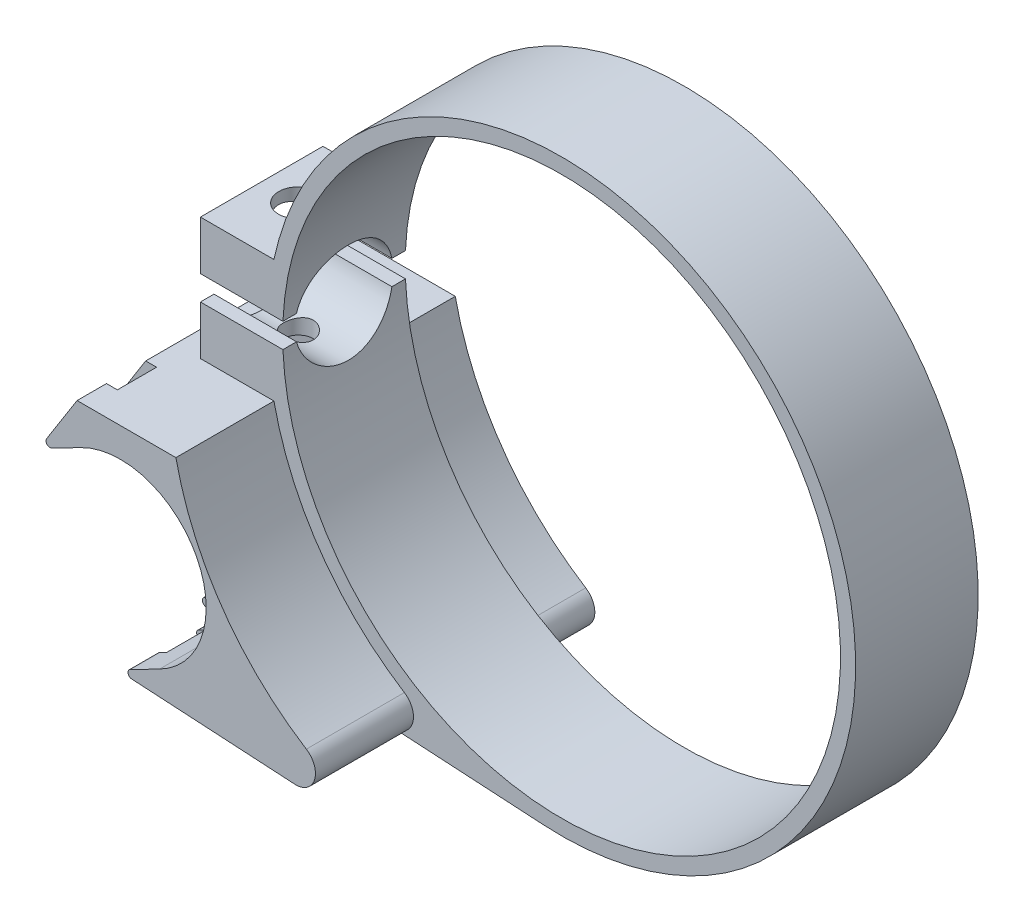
ISO-10303-21;
HEADER;
FILE_DESCRIPTION(('STEP AP214'),'2;1');
FILE_NAME('part.step','',(''),(''),'','','');
FILE_SCHEMA(('AUTOMOTIVE_DESIGN { 1 0 10303 214 1 1 1 1 }'));
ENDSEC;
DATA;
#1=APPLICATION_CONTEXT('core data for automotive mechanical design processes');
#2=APPLICATION_PROTOCOL_DEFINITION('international standard','automotive_design',2000,#1);
#3=PRODUCT_CONTEXT('',#1,'mechanical');
#4=PRODUCT('Part','Part','',(#3));
#5=PRODUCT_RELATED_PRODUCT_CATEGORY('part','',(#4));
#6=PRODUCT_DEFINITION_FORMATION('','',#4);
#7=PRODUCT_DEFINITION_CONTEXT('part definition',#1,'design');
#8=PRODUCT_DEFINITION('design','',#6,#7);
#9=PRODUCT_DEFINITION_SHAPE('','',#8);
#10=(LENGTH_UNIT() NAMED_UNIT(*) SI_UNIT(.MILLI.,.METRE.));
#11=(NAMED_UNIT(*) PLANE_ANGLE_UNIT() SI_UNIT($,.RADIAN.));
#12=(NAMED_UNIT(*) SI_UNIT($,.STERADIAN.) SOLID_ANGLE_UNIT());
#13=UNCERTAINTY_MEASURE_WITH_UNIT(LENGTH_MEASURE(1.E-05),#10,'distance_accuracy_value','');
#14=(GEOMETRIC_REPRESENTATION_CONTEXT(3) GLOBAL_UNCERTAINTY_ASSIGNED_CONTEXT((#13)) GLOBAL_UNIT_ASSIGNED_CONTEXT((#10,
#11,#12)) REPRESENTATION_CONTEXT('',''));
#15=CARTESIAN_POINT('',(0.,0.,0.));
#16=DIRECTION('',(0.,0.,1.));
#17=DIRECTION('',(1.,0.,0.));
#18=AXIS2_PLACEMENT_3D('',#15,#16,#17);
#19=CARTESIAN_POINT('',(-44.4521651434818,-22.8354037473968,9.525));
#20=DIRECTION('',(0.,0.,-1.));
#21=DIRECTION('',(-1.,0.,0.));
#22=AXIS2_PLACEMENT_3D('',#19,#20,#21);
#23=CYLINDRICAL_SURFACE('',#22,9.652);
#24=DIRECTION('',(0.,0.,-1.));
#25=VECTOR('',#24,1.);
#26=CARTESIAN_POINT('',(-37.26400533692,-16.3940170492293,9.525));
#27=LINE('',#26,#25);
#28=CARTESIAN_POINT('',(-37.26400533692,-16.3940170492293,9.525));
#29=VERTEX_POINT('',#28);
#30=CARTESIAN_POINT('',(-37.26400533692,-16.3940170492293,6.35));
#31=VERTEX_POINT('',#30);
#32=EDGE_CURVE('E460',#29,#31,#27,.T.);
#33=ORIENTED_EDGE('',*,*,#32,.T.);
#34=CARTESIAN_POINT('',(-44.4521651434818,-22.8354037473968,6.35));
#35=DIRECTION('',(0.,0.,1.));
#36=DIRECTION('',(1.,0.,0.));
#37=AXIS2_PLACEMENT_3D('',#34,#35,#36);
#38=CIRCLE('',#37,9.652);
#39=CARTESIAN_POINT('',(-38.7116501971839,-30.5947588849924,6.35));
#40=VERTEX_POINT('',#39);
#41=EDGE_CURVE('E785',#40,#31,#38,.T.);
#42=ORIENTED_EDGE('',*,*,#41,.F.);
#43=DIRECTION('',(0.,0.,-1.));
#44=VECTOR('',#43,1.);
#45=CARTESIAN_POINT('',(-38.7116501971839,-30.5947588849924,9.525));
#46=LINE('',#45,#44);
#47=CARTESIAN_POINT('',(-38.7116501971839,-30.5947588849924,9.525));
#48=VERTEX_POINT('',#47);
#49=EDGE_CURVE('E1085',#48,#40,#46,.T.);
#50=ORIENTED_EDGE('',*,*,#49,.F.);
#51=CARTESIAN_POINT('',(-44.4521651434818,-22.8354037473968,9.525));
#52=DIRECTION('',(0.,0.,1.));
#53=DIRECTION('',(1.,0.,0.));
#54=AXIS2_PLACEMENT_3D('',#51,#52,#53);
#55=CIRCLE('',#54,9.652);
#56=EDGE_CURVE('E779',#48,#29,#55,.T.);
#57=ORIENTED_EDGE('',*,*,#56,.T.);
#58=EDGE_LOOP('',(#33,#42,#50,#57));
#59=FACE_BOUND('',#58,.T.);
#60=ADVANCED_FACE('F41',(#59),#23,.F.);
#61=CARTESIAN_POINT('',(0.,0.,9.525));
#62=DIRECTION('',(0.,0.,1.));
#63=DIRECTION('',(1.,0.,0.));
#64=AXIS2_PLACEMENT_3D('',#61,#62,#63);
#65=PLANE('',#64);
#66=DIRECTION('',(0.,-1.,0.));
#67=VECTOR('',#66,1.);
#68=CARTESIAN_POINT('',(-37.26400533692,-38.101,9.525));
#69=LINE('',#68,#67);
#70=CARTESIAN_POINT('',(-37.26400533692,-14.3608527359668,9.525));
#71=VERTEX_POINT('',#70);
#72=EDGE_CURVE('E453',#71,#29,#69,.T.);
#73=ORIENTED_EDGE('',*,*,#72,.T.);
#74=ORIENTED_EDGE('',*,*,#56,.F.);
#75=DIRECTION('',(-0.889496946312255,-0.456941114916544,0.));
#76=VECTOR('',#75,1.);
#77=CARTESIAN_POINT('',(4.35236411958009,-8.47245841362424,9.525));
#78=LINE('',#77,#76);
#79=CARTESIAN_POINT('',(-35.0084871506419,-28.6924168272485,9.525));
#80=VERTEX_POINT('',#79);
#81=EDGE_CURVE('E582',#80,#48,#78,.T.);
#82=ORIENTED_EDGE('',*,*,#81,.F.);
#83=CARTESIAN_POINT('',(-44.4521651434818,-22.8354037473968,9.525));
#84=DIRECTION('',(0.,0.,1.));
#85=DIRECTION('',(1.,0.,0.));
#86=AXIS2_PLACEMENT_3D('',#83,#84,#85);
#87=CIRCLE('',#86,11.1125);
#88=EDGE_CURVE('E780',#80,#71,#87,.T.);
#89=ORIENTED_EDGE('',*,*,#88,.T.);
#90=EDGE_LOOP('',(#73,#74,#82,#89));
#91=FACE_BOUND('',#90,.T.);
#92=ADVANCED_FACE('F742',(#91),#65,.T.);
#93=CARTESIAN_POINT('',(0.,0.,6.35));
#94=DIRECTION('',(0.,0.,1.));
#95=DIRECTION('',(1.,0.,0.));
#96=AXIS2_PLACEMENT_3D('',#93,#94,#95);
#97=PLANE('',#96);
#98=ORIENTED_EDGE('',*,*,#41,.T.);
#99=DIRECTION('',(0.,-1.,0.));
#100=VECTOR('',#99,1.);
#101=CARTESIAN_POINT('',(-37.26400533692,-38.101,6.35));
#102=LINE('',#101,#100);
#103=CARTESIAN_POINT('',(-37.26400533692,-14.3608527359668,6.35));
#104=VERTEX_POINT('',#103);
#105=EDGE_CURVE('E437',#104,#31,#102,.T.);
#106=ORIENTED_EDGE('',*,*,#105,.F.);
#107=CARTESIAN_POINT('',(-44.4521651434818,-22.8354037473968,6.35));
#108=DIRECTION('',(0.,0.,1.));
#109=DIRECTION('',(1.,0.,0.));
#110=AXIS2_PLACEMENT_3D('',#107,#108,#109);
#111=CIRCLE('',#110,11.1125);
#112=CARTESIAN_POINT('',(-35.0084871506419,-28.6924168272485,6.35));
#113=VERTEX_POINT('',#112);
#114=EDGE_CURVE('E789',#113,#104,#111,.T.);
#115=ORIENTED_EDGE('',*,*,#114,.F.);
#116=DIRECTION('',(-0.889496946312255,-0.456941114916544,0.));
#117=VECTOR('',#116,1.);
#118=CARTESIAN_POINT('',(4.35236411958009,-8.47245841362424,6.35));
#119=LINE('',#118,#117);
#120=EDGE_CURVE('E634',#113,#40,#119,.T.);
#121=ORIENTED_EDGE('',*,*,#120,.T.);
#122=EDGE_LOOP('',(#98,#106,#115,#121));
#123=FACE_BOUND('',#122,.T.);
#124=ADVANCED_FACE('F749',(#123),#97,.F.);
#125=CARTESIAN_POINT('',(0.,-7.9375,15.875));
#126=DIRECTION('',(0.,-1.,0.));
#127=DIRECTION('',(1.,0.,0.));
#128=AXIS2_PLACEMENT_3D('',#125,#126,#127);
#129=PLANE('',#128);
#130=DIRECTION('',(-1.,0.,0.));
#131=VECTOR('',#130,1.);
#132=CARTESIAN_POINT('',(0.,-7.9375,19.685));
#133=LINE('',#132,#131);
#134=CARTESIAN_POINT('',(-48.6553468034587,-7.9375,19.685));
#135=VERTEX_POINT('',#134);
#136=CARTESIAN_POINT('',(-50.0665307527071,-7.93749999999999,19.685));
#137=VERTEX_POINT('',#136);
#138=EDGE_CURVE('E523',#135,#137,#133,.T.);
#139=ORIENTED_EDGE('',*,*,#138,.F.);
#140=DIRECTION('',(0.,0.,-1.));
#141=VECTOR('',#140,1.);
#142=CARTESIAN_POINT('',(-48.6553468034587,-7.9375,15.875));
#143=LINE('',#142,#141);
#144=CARTESIAN_POINT('',(-48.6553468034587,-7.9375,24.765));
#145=VERTEX_POINT('',#144);
#146=EDGE_CURVE('E527',#145,#135,#143,.T.);
#147=ORIENTED_EDGE('',*,*,#146,.F.);
#148=DIRECTION('',(-1.,0.,0.));
#149=VECTOR('',#148,1.);
#150=CARTESIAN_POINT('',(0.,-7.9375,24.765));
#151=LINE('',#150,#149);
#152=CARTESIAN_POINT('',(-50.0665307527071,-7.93749999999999,24.765));
#153=VERTEX_POINT('',#152);
#154=EDGE_CURVE('E504',#145,#153,#151,.T.);
#155=ORIENTED_EDGE('',*,*,#154,.T.);
#156=DIRECTION('',(0.,0.,-1.));
#157=VECTOR('',#156,1.);
#158=CARTESIAN_POINT('',(-50.0665307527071,-7.9375,15.875));
#159=LINE('',#158,#157);
#160=CARTESIAN_POINT('',(-50.0665307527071,-7.9375,28.575));
#161=VERTEX_POINT('',#160);
#162=EDGE_CURVE('E800',#161,#153,#159,.T.);
#163=ORIENTED_EDGE('',*,*,#162,.F.);
#164=DIRECTION('',(-1.,0.,0.));
#165=VECTOR('',#164,1.);
#166=CARTESIAN_POINT('',(0.,-7.9375,28.575));
#167=LINE('',#166,#165);
#168=CARTESIAN_POINT('',(-37.26400533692,-7.9375,28.575));
#169=VERTEX_POINT('',#168);
#170=EDGE_CURVE('E533',#169,#161,#167,.T.);
#171=ORIENTED_EDGE('',*,*,#170,.F.);
#172=DIRECTION('',(0.,0.,-1.));
#173=VECTOR('',#172,1.);
#174=CARTESIAN_POINT('',(-37.26400533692,-7.9375,28.575));
#175=LINE('',#174,#173);
#176=CARTESIAN_POINT('',(-37.26400533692,-7.9375,15.875));
#177=VERTEX_POINT('',#176);
#178=EDGE_CURVE('E558',#169,#177,#175,.T.);
#179=ORIENTED_EDGE('',*,*,#178,.T.);
#180=DIRECTION('',(-1.,0.,0.));
#181=VECTOR('',#180,1.);
#182=CARTESIAN_POINT('',(0.,-7.9375,15.875));
#183=LINE('',#182,#181);
#184=CARTESIAN_POINT('',(-46.78900533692,-7.9375,15.875));
#185=VERTEX_POINT('',#184);
#186=EDGE_CURVE('E554',#177,#185,#183,.T.);
#187=ORIENTED_EDGE('',*,*,#186,.T.);
#188=DIRECTION('',(0.,0.,-1.));
#189=VECTOR('',#188,1.);
#190=CARTESIAN_POINT('',(-46.78900533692,-7.9375,15.875));
#191=LINE('',#190,#189);
#192=CARTESIAN_POINT('',(-46.78900533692,-7.9375,0.));
#193=VERTEX_POINT('',#192);
#194=EDGE_CURVE('E1015',#185,#193,#191,.T.);
#195=ORIENTED_EDGE('',*,*,#194,.T.);
#196=DIRECTION('',(-1.,0.,0.));
#197=VECTOR('',#196,1.);
#198=CARTESIAN_POINT('',(0.,-7.9375,0.));
#199=LINE('',#198,#197);
#200=CARTESIAN_POINT('',(-37.26400533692,-7.9375,0.));
#201=VERTEX_POINT('',#200);
#202=EDGE_CURVE('E1003',#201,#193,#199,.T.);
#203=ORIENTED_EDGE('',*,*,#202,.F.);
#204=DIRECTION('',(0.,0.,1.));
#205=VECTOR('',#204,1.);
#206=CARTESIAN_POINT('',(-37.26400533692,-7.9375,-7.62));
#207=LINE('',#206,#205);
#208=CARTESIAN_POINT('',(-37.26400533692,-7.9375,-7.62));
#209=VERTEX_POINT('',#208);
#210=EDGE_CURVE('E792',#209,#201,#207,.T.);
#211=ORIENTED_EDGE('',*,*,#210,.F.);
#212=DIRECTION('',(-1.,0.,0.));
#213=VECTOR('',#212,1.);
#214=CARTESIAN_POINT('',(0.,-7.9375,-7.62));
#215=LINE('',#214,#213);
#216=CARTESIAN_POINT('',(-50.0665307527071,-7.9375,-7.62));
#217=VERTEX_POINT('',#216);
#218=EDGE_CURVE('E990',#209,#217,#215,.T.);
#219=ORIENTED_EDGE('',*,*,#218,.T.);
#220=EDGE_CURVE('E803',#137,#217,#159,.T.);
#221=ORIENTED_EDGE('',*,*,#220,.F.);
#222=EDGE_LOOP('',(#139,#147,#155,#163,#171,#179,#187,#195,#203,#211,#219,#221));
#223=FACE_BOUND('',#222,.T.);
#224=ADVANCED_FACE('F954',(#223),#129,.F.);
#225=CARTESIAN_POINT('',(5.0777581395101,-9.88453481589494,15.875));
#226=DIRECTION('',(0.456941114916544,-0.889496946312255,0.));
#227=DIRECTION('',(0.889496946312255,0.456941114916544,0.));
#228=AXIS2_PLACEMENT_3D('',#225,#226,#227);
#229=PLANE('',#228);
#230=DIRECTION('',(-0.889496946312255,-0.456941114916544,0.));
#231=VECTOR('',#230,1.);
#232=CARTESIAN_POINT('',(5.0777581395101,-9.88453481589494,19.685));
#233=LINE('',#232,#231);
#234=CARTESIAN_POINT('',(-42.2728424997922,-34.2088861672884,19.685));
#235=VERTEX_POINT('',#234);
#236=CARTESIAN_POINT('',(-43.1972534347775,-34.6837628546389,19.685));
#237=VERTEX_POINT('',#236);
#238=EDGE_CURVE('E509',#235,#237,#233,.T.);
#239=ORIENTED_EDGE('',*,*,#238,.F.);
#240=DIRECTION('',(0.,0.,-1.));
#241=VECTOR('',#240,1.);
#242=CARTESIAN_POINT('',(-42.2728424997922,-34.2088861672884,15.875));
#243=LINE('',#242,#241);
#244=CARTESIAN_POINT('',(-42.2728424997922,-34.2088861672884,24.765));
#245=VERTEX_POINT('',#244);
#246=EDGE_CURVE('E525',#245,#235,#243,.T.);
#247=ORIENTED_EDGE('',*,*,#246,.F.);
#248=DIRECTION('',(-0.889496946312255,-0.456941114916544,0.));
#249=VECTOR('',#248,1.);
#250=CARTESIAN_POINT('',(5.0777581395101,-9.88453481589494,24.765));
#251=LINE('',#250,#249);
#252=CARTESIAN_POINT('',(-43.1972534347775,-34.6837628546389,24.765));
#253=VERTEX_POINT('',#252);
#254=EDGE_CURVE('E494',#245,#253,#251,.T.);
#255=ORIENTED_EDGE('',*,*,#254,.T.);
#256=DIRECTION('',(0.,0.,-1.));
#257=VECTOR('',#256,1.);
#258=CARTESIAN_POINT('',(-43.1972534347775,-34.683762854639,15.875));
#259=LINE('',#258,#257);
#260=CARTESIAN_POINT('',(-43.1972534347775,-34.683762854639,28.575));
#261=VERTEX_POINT('',#260);
#262=EDGE_CURVE('E882',#253,#261,#259,.F.);
#263=ORIENTED_EDGE('',*,*,#262,.T.);
#264=DIRECTION('',(-0.889496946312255,-0.456941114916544,0.));
#265=VECTOR('',#264,1.);
#266=CARTESIAN_POINT('',(5.0777581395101,-9.88453481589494,28.575));
#267=LINE('',#266,#265);
#268=CARTESIAN_POINT('',(-39.3744070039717,-32.7199385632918,28.575));
#269=VERTEX_POINT('',#268);
#270=EDGE_CURVE('E545',#269,#261,#267,.T.);
#271=ORIENTED_EDGE('',*,*,#270,.F.);
#272=DIRECTION('',(0.,0.,-1.));
#273=VECTOR('',#272,1.);
#274=CARTESIAN_POINT('',(-39.3744070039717,-32.7199385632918,28.575));
#275=LINE('',#274,#273);
#276=CARTESIAN_POINT('',(-39.3744070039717,-32.7199385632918,15.875));
#277=VERTEX_POINT('',#276);
#278=EDGE_CURVE('E551',#269,#277,#275,.T.);
#279=ORIENTED_EDGE('',*,*,#278,.T.);
#280=DIRECTION('',(-0.889496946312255,-0.456941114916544,0.));
#281=VECTOR('',#280,1.);
#282=CARTESIAN_POINT('',(5.0777581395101,-9.88453481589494,15.875));
#283=LINE('',#282,#281);
#284=CARTESIAN_POINT('',(-43.1972534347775,-34.683762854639,15.875));
#285=VERTEX_POINT('',#284);
#286=EDGE_CURVE('E534',#277,#285,#283,.T.);
#287=ORIENTED_EDGE('',*,*,#286,.T.);
#288=EDGE_CURVE('E883',#285,#237,#259,.F.);
#289=ORIENTED_EDGE('',*,*,#288,.T.);
#290=EDGE_LOOP('',(#239,#247,#255,#263,#271,#279,#287,#289));
#291=FACE_BOUND('',#290,.T.);
#292=ADVANCED_FACE('F932',(#291),#229,.F.);
#293=CARTESIAN_POINT('',(-2.23172413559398,-38.0345817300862,15.875));
#294=DIRECTION('',(0.0585754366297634,0.998282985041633,0.));
#295=DIRECTION('',(-0.998282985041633,0.0585754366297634,0.));
#296=AXIS2_PLACEMENT_3D('',#293,#294,#295);
#297=PLANE('',#296);
#298=DIRECTION('',(0.998282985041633,-0.0585754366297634,0.));
#299=VECTOR('',#298,1.);
#300=CARTESIAN_POINT('',(-2.23172413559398,-38.0345817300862,19.685));
#301=LINE('',#300,#299);
#302=CARTESIAN_POINT('',(-42.9948836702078,-35.6427550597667,19.685));
#303=VERTEX_POINT('',#302);
#304=CARTESIAN_POINT('',(-21.8726976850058,-36.8821243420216,19.685));
#305=VERTEX_POINT('',#304);
#306=EDGE_CURVE('E507',#303,#305,#301,.T.);
#307=ORIENTED_EDGE('',*,*,#306,.F.);
#308=DIRECTION('',(0.,0.,-1.));
#309=VECTOR('',#308,1.);
#310=CARTESIAN_POINT('',(-42.9948836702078,-35.6427550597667,15.875));
#311=LINE('',#310,#309);
#312=CARTESIAN_POINT('',(-42.9948836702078,-35.6427550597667,-7.62));
#313=VERTEX_POINT('',#312);
#314=EDGE_CURVE('E878',#303,#313,#311,.T.);
#315=ORIENTED_EDGE('',*,*,#314,.T.);
#316=DIRECTION('',(0.998282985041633,-0.0585754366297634,0.));
#317=VECTOR('',#316,1.);
#318=CARTESIAN_POINT('',(-2.23172413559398,-38.0345817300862,-7.62));
#319=LINE('',#318,#317);
#320=CARTESIAN_POINT('',(-21.8726976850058,-36.8821243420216,-7.62));
#321=VERTEX_POINT('',#320);
#322=EDGE_CURVE('E981',#313,#321,#319,.T.);
#323=ORIENTED_EDGE('',*,*,#322,.T.);
#324=DIRECTION('',(0.,0.,1.));
#325=VECTOR('',#324,1.);
#326=CARTESIAN_POINT('',(-21.8726976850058,-36.8821243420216,15.875));
#327=LINE('',#326,#325);
#328=CARTESIAN_POINT('',(-21.8726976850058,-36.8821243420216,0.));
#329=VERTEX_POINT('',#328);
#330=EDGE_CURVE('E840',#321,#329,#327,.T.);
#331=ORIENTED_EDGE('',*,*,#330,.T.);
#332=DIRECTION('',(0.998282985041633,-0.0585754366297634,0.));
#333=VECTOR('',#332,1.);
#334=CARTESIAN_POINT('',(-2.23172413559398,-38.0345817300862,0.));
#335=LINE('',#334,#333);
#336=CARTESIAN_POINT('',(-2.23172413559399,-38.0345817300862,0.));
#337=VERTEX_POINT('',#336);
#338=EDGE_CURVE('E838',#329,#337,#335,.T.);
#339=ORIENTED_EDGE('',*,*,#338,.T.);
#340=DIRECTION('',(0.,0.,-1.));
#341=VECTOR('',#340,1.);
#342=CARTESIAN_POINT('',(-2.23172413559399,-38.0345817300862,15.875));
#343=LINE('',#342,#341);
#344=CARTESIAN_POINT('',(-2.23172413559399,-38.0345817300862,15.875));
#345=VERTEX_POINT('',#344);
#346=EDGE_CURVE('E802',#345,#337,#343,.T.);
#347=ORIENTED_EDGE('',*,*,#346,.F.);
#348=DIRECTION('',(-0.998282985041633,0.0585754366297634,0.));
#349=VECTOR('',#348,1.);
#350=CARTESIAN_POINT('',(-2.23172413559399,-38.0345817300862,15.875));
#351=LINE('',#350,#349);
#352=CARTESIAN_POINT('',(-21.8726976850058,-36.8821243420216,15.875));
#353=VERTEX_POINT('',#352);
#354=EDGE_CURVE('E847',#345,#353,#351,.T.);
#355=ORIENTED_EDGE('',*,*,#354,.T.);
#356=DIRECTION('',(0.,0.,1.));
#357=VECTOR('',#356,1.);
#358=CARTESIAN_POINT('',(-21.8726976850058,-36.8821243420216,28.575));
#359=LINE('',#358,#357);
#360=EDGE_CURVE('E844',#353,#305,#359,.T.);
#361=ORIENTED_EDGE('',*,*,#360,.T.);
#362=EDGE_LOOP('',(#307,#315,#323,#331,#339,#347,#355,#361));
#363=FACE_BOUND('',#362,.T.);
#364=ADVANCED_FACE('F977',(#363),#297,.F.);
#365=CARTESIAN_POINT('',(-32.2179161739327,20.3375484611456,15.875));
#366=DIRECTION('',(-0.845614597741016,0.533793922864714,0.));
#367=DIRECTION('',(-0.533793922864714,-0.845614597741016,0.));
#368=AXIS2_PLACEMENT_3D('',#365,#366,#367);
#369=PLANE('',#368);
#370=DIRECTION('',(0.,0.,-1.));
#371=VECTOR('',#370,1.);
#372=CARTESIAN_POINT('',(-54.0144680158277,-14.1916614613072,15.875));
#373=LINE('',#372,#371);
#374=CARTESIAN_POINT('',(-54.0144680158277,-14.1916614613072,-7.62));
#375=VERTEX_POINT('',#374);
#376=CARTESIAN_POINT('',(-54.0144680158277,-14.1916614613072,19.685));
#377=VERTEX_POINT('',#376);
#378=EDGE_CURVE('E871',#375,#377,#373,.F.);
#379=ORIENTED_EDGE('',*,*,#378,.T.);
#380=DIRECTION('',(0.533793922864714,0.845614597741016,0.));
#381=VECTOR('',#380,1.);
#382=CARTESIAN_POINT('',(-32.2179161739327,20.3375484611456,19.685));
#383=LINE('',#382,#381);
#384=EDGE_CURVE('E520',#377,#137,#383,.T.);
#385=ORIENTED_EDGE('',*,*,#384,.T.);
#386=ORIENTED_EDGE('',*,*,#220,.T.);
#387=DIRECTION('',(0.533793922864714,0.845614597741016,0.));
#388=VECTOR('',#387,1.);
#389=CARTESIAN_POINT('',(-32.2179161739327,20.3375484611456,-7.62));
#390=LINE('',#389,#388);
#391=EDGE_CURVE('E998',#375,#217,#390,.T.);
#392=ORIENTED_EDGE('',*,*,#391,.F.);
#393=EDGE_LOOP('',(#379,#385,#386,#392));
#394=FACE_BOUND('',#393,.T.);
#395=ADVANCED_FACE('F767',(#394),#369,.T.);
#396=CARTESIAN_POINT('',(-5.07775813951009,9.88453481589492,15.875));
#397=DIRECTION('',(0.456941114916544,-0.889496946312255,0.));
#398=DIRECTION('',(0.889496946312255,0.456941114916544,0.));
#399=AXIS2_PLACEMENT_3D('',#396,#397,#398);
#400=PLANE('',#399);
#401=DIRECTION('',(0.,0.,-1.));
#402=VECTOR('',#401,1.);
#403=CARTESIAN_POINT('',(-52.4283587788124,-14.4398165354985,15.875));
#404=LINE('',#403,#402);
#405=CARTESIAN_POINT('',(-52.4283587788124,-14.4398165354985,24.765));
#406=VERTEX_POINT('',#405);
#407=CARTESIAN_POINT('',(-52.4283587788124,-14.4398165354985,19.685));
#408=VERTEX_POINT('',#407);
#409=EDGE_CURVE('E12',#406,#408,#404,.T.);
#410=ORIENTED_EDGE('',*,*,#409,.T.);
#411=DIRECTION('',(-0.889496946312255,-0.456941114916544,0.));
#412=VECTOR('',#411,1.);
#413=CARTESIAN_POINT('',(-5.07775813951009,9.88453481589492,19.685));
#414=LINE('',#413,#412);
#415=CARTESIAN_POINT('',(-53.3527697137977,-14.9146932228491,19.685));
#416=VERTEX_POINT('',#415);
#417=EDGE_CURVE('E517',#408,#416,#414,.T.);
#418=ORIENTED_EDGE('',*,*,#417,.T.);
#419=DIRECTION('',(0.,0.,-1.));
#420=VECTOR('',#419,1.);
#421=CARTESIAN_POINT('',(-53.3527697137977,-14.9146932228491,15.875));
#422=LINE('',#421,#420);
#423=CARTESIAN_POINT('',(-53.3527697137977,-14.9146932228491,15.875));
#424=VERTEX_POINT('',#423);
#425=EDGE_CURVE('E861',#416,#424,#422,.T.);
#426=ORIENTED_EDGE('',*,*,#425,.T.);
#427=DIRECTION('',(-0.889496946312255,-0.456941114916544,0.));
#428=VECTOR('',#427,1.);
#429=CARTESIAN_POINT('',(-5.07775813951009,9.88453481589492,15.875));
#430=LINE('',#429,#428);
#431=CARTESIAN_POINT('',(-49.5299232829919,-12.9508689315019,15.875));
#432=VERTEX_POINT('',#431);
#433=EDGE_CURVE('E1033',#432,#424,#430,.T.);
#434=ORIENTED_EDGE('',*,*,#433,.F.);
#435=DIRECTION('',(0.,0.,-1.));
#436=VECTOR('',#435,1.);
#437=CARTESIAN_POINT('',(-49.5299232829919,-12.9508689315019,28.575));
#438=LINE('',#437,#436);
#439=CARTESIAN_POINT('',(-49.5299232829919,-12.9508689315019,28.575));
#440=VERTEX_POINT('',#439);
#441=EDGE_CURVE('E556',#440,#432,#438,.T.);
#442=ORIENTED_EDGE('',*,*,#441,.F.);
#443=DIRECTION('',(-0.889496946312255,-0.456941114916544,0.));
#444=VECTOR('',#443,1.);
#445=CARTESIAN_POINT('',(-5.07775813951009,9.88453481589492,28.575));
#446=LINE('',#445,#444);
#447=CARTESIAN_POINT('',(-53.3527697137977,-14.9146932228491,28.575));
#448=VERTEX_POINT('',#447);
#449=EDGE_CURVE('E539',#440,#448,#446,.T.);
#450=ORIENTED_EDGE('',*,*,#449,.T.);
#451=CARTESIAN_POINT('',(-53.3527697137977,-14.9146932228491,24.765));
#452=VERTEX_POINT('',#451);
#453=EDGE_CURVE('E862',#448,#452,#422,.T.);
#454=ORIENTED_EDGE('',*,*,#453,.T.);
#455=DIRECTION('',(-0.889496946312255,-0.456941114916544,0.));
#456=VECTOR('',#455,1.);
#457=CARTESIAN_POINT('',(-5.07775813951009,9.88453481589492,24.765));
#458=LINE('',#457,#456);
#459=EDGE_CURVE('E64',#406,#452,#458,.T.);
#460=ORIENTED_EDGE('',*,*,#459,.F.);
#461=EDGE_LOOP('',(#410,#418,#426,#434,#442,#450,#454,#460));
#462=FACE_BOUND('',#461,.T.);
#463=ADVANCED_FACE('F717',(#462),#400,.T.);
#464=CARTESIAN_POINT('',(-21.7239160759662,-34.3464855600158,28.575));
#465=DIRECTION('',(0.,0.,-1.));
#466=DIRECTION('',(-1.,0.,0.));
#467=AXIS2_PLACEMENT_3D('',#464,#465,#466);
#468=CYLINDRICAL_SURFACE('',#467,2.54);
#469=DIRECTION('',(0.,0.,-1.));
#470=VECTOR('',#469,1.);
#471=CARTESIAN_POINT('',(-20.1468838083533,-36.3376081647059,28.575));
#472=LINE('',#471,#470);
#473=CARTESIAN_POINT('',(-20.1468838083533,-36.3376081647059,24.765));
#474=VERTEX_POINT('',#473);
#475=CARTESIAN_POINT('',(-20.1468838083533,-36.3376081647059,19.685));
#476=VERTEX_POINT('',#475);
#477=EDGE_CURVE('E49',#474,#476,#472,.T.);
#478=ORIENTED_EDGE('',*,*,#477,.T.);
#479=CARTESIAN_POINT('',(-21.7239160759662,-34.3464855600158,19.685));
#480=DIRECTION('',(0.,0.,1.));
#481=DIRECTION('',(1.,0.,0.));
#482=AXIS2_PLACEMENT_3D('',#479,#480,#481);
#483=CIRCLE('',#482,2.54);
#484=EDGE_CURVE('E511',#476,#305,#483,.F.);
#485=ORIENTED_EDGE('',*,*,#484,.T.);
#486=ORIENTED_EDGE('',*,*,#360,.F.);
#487=CARTESIAN_POINT('',(-21.7239160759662,-34.3464855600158,15.875));
#488=DIRECTION('',(0.,0.,1.));
#489=DIRECTION('',(1.,0.,0.));
#490=AXIS2_PLACEMENT_3D('',#487,#488,#489);
#491=CIRCLE('',#490,2.54);
#492=CARTESIAN_POINT('',(-20.3661713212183,-32.1998302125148,15.875));
#493=VERTEX_POINT('',#492);
#494=EDGE_CURVE('E857',#493,#353,#491,.F.);
#495=ORIENTED_EDGE('',*,*,#494,.F.);
#496=DIRECTION('',(0.,0.,-1.));
#497=VECTOR('',#496,1.);
#498=CARTESIAN_POINT('',(-20.3661713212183,-32.1998302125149,28.575));
#499=LINE('',#498,#497);
#500=CARTESIAN_POINT('',(-20.3661713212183,-32.1998302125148,28.575));
#501=VERTEX_POINT('',#500);
#502=EDGE_CURVE('E581',#501,#493,#499,.T.);
#503=ORIENTED_EDGE('',*,*,#502,.F.);
#504=CARTESIAN_POINT('',(-21.7239160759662,-34.3464855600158,28.575));
#505=DIRECTION('',(0.,0.,1.));
#506=DIRECTION('',(1.,0.,0.));
#507=AXIS2_PLACEMENT_3D('',#504,#505,#506);
#508=CIRCLE('',#507,2.54);
#509=CARTESIAN_POINT('',(-21.8726976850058,-36.8821243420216,28.575));
#510=VERTEX_POINT('',#509);
#511=EDGE_CURVE('E850',#510,#501,#508,.T.);
#512=ORIENTED_EDGE('',*,*,#511,.F.);
#513=CARTESIAN_POINT('',(-21.8726976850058,-36.8821243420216,24.765));
#514=VERTEX_POINT('',#513);
#515=EDGE_CURVE('E843',#514,#510,#359,.T.);
#516=ORIENTED_EDGE('',*,*,#515,.F.);
#517=CARTESIAN_POINT('',(-21.7239160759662,-34.3464855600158,24.765));
#518=DIRECTION('',(0.,0.,1.));
#519=DIRECTION('',(1.,0.,0.));
#520=AXIS2_PLACEMENT_3D('',#517,#518,#519);
#521=CIRCLE('',#520,2.54);
#522=EDGE_CURVE('E497',#474,#514,#521,.F.);
#523=ORIENTED_EDGE('',*,*,#522,.F.);
#524=EDGE_LOOP('',(#478,#485,#486,#495,#503,#512,#516,#523));
#525=FACE_BOUND('',#524,.T.);
#526=ADVANCED_FACE('F713',(#525),#468,.T.);
#527=CARTESIAN_POINT('',(-53.5848958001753,-14.4628287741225,15.875));
#528=DIRECTION('',(0.,0.,-1.));
#529=DIRECTION('',(-1.,0.,0.));
#530=AXIS2_PLACEMENT_3D('',#527,#528,#529);
#531=CYLINDRICAL_SURFACE('',#530,0.508);
#532=ORIENTED_EDGE('',*,*,#425,.F.);
#533=CARTESIAN_POINT('',(-53.5848958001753,-14.4628287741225,19.685));
#534=DIRECTION('',(0.,0.,1.));
#535=DIRECTION('',(1.,0.,0.));
#536=AXIS2_PLACEMENT_3D('',#533,#534,#535);
#537=CIRCLE('',#536,0.508);
#538=EDGE_CURVE('E514',#416,#377,#537,.F.);
#539=ORIENTED_EDGE('',*,*,#538,.T.);
#540=ORIENTED_EDGE('',*,*,#378,.F.);
#541=CARTESIAN_POINT('',(-53.5848958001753,-14.4628287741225,-7.62));
#542=DIRECTION('',(0.,0.,1.));
#543=DIRECTION('',(1.,0.,0.));
#544=AXIS2_PLACEMENT_3D('',#541,#542,#543);
#545=CIRCLE('',#544,0.508);
#546=CARTESIAN_POINT('',(-54.0839412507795,-14.5577900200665,-7.62));
#547=VERTEX_POINT('',#546);
#548=EDGE_CURVE('E868',#547,#375,#545,.F.);
#549=ORIENTED_EDGE('',*,*,#548,.F.);
#550=DIRECTION('',(0.,0.,-1.));
#551=VECTOR('',#550,1.);
#552=CARTESIAN_POINT('',(-54.0839412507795,-14.5577900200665,15.875));
#553=LINE('',#552,#551);
#554=CARTESIAN_POINT('',(-54.0839412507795,-14.5577900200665,15.875));
#555=VERTEX_POINT('',#554);
#556=EDGE_CURVE('E888',#555,#547,#553,.T.);
#557=ORIENTED_EDGE('',*,*,#556,.F.);
#558=CARTESIAN_POINT('',(-53.5848958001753,-14.4628287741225,15.875));
#559=DIRECTION('',(0.,0.,1.));
#560=DIRECTION('',(1.,0.,0.));
#561=AXIS2_PLACEMENT_3D('',#558,#559,#560);
#562=CIRCLE('',#561,0.508);
#563=EDGE_CURVE('E886',#424,#555,#562,.F.);
#564=ORIENTED_EDGE('',*,*,#563,.F.);
#565=EDGE_LOOP('',(#532,#539,#540,#549,#557,#564));
#566=FACE_BOUND('',#565,.T.);
#567=ADVANCED_FACE('F716',(#566),#531,.T.);
#568=CARTESIAN_POINT('',(-42.9651273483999,-35.1356273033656,15.875));
#569=DIRECTION('',(0.,0.,-1.));
#570=DIRECTION('',(-1.,0.,0.));
#571=AXIS2_PLACEMENT_3D('',#568,#569,#570);
#572=CYLINDRICAL_SURFACE('',#571,0.508);
#573=ORIENTED_EDGE('',*,*,#314,.F.);
#574=CARTESIAN_POINT('',(-42.9651273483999,-35.1356273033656,19.685));
#575=DIRECTION('',(0.,0.,1.));
#576=DIRECTION('',(1.,0.,0.));
#577=AXIS2_PLACEMENT_3D('',#574,#575,#576);
#578=CIRCLE('',#577,0.508);
#579=EDGE_CURVE('E915',#303,#237,#578,.F.);
#580=ORIENTED_EDGE('',*,*,#579,.T.);
#581=ORIENTED_EDGE('',*,*,#288,.F.);
#582=CARTESIAN_POINT('',(-42.9651273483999,-35.1356273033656,15.875));
#583=DIRECTION('',(0.,0.,1.));
#584=DIRECTION('',(1.,0.,0.));
#585=AXIS2_PLACEMENT_3D('',#582,#583,#584);
#586=CIRCLE('',#585,0.508);
#587=CARTESIAN_POINT('',(-43.3329697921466,-35.485992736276,15.875));
#588=VERTEX_POINT('',#587);
#589=EDGE_CURVE('E894',#588,#285,#586,.F.);
#590=ORIENTED_EDGE('',*,*,#589,.F.);
#591=DIRECTION('',(0.,0.,-1.));
#592=VECTOR('',#591,1.);
#593=CARTESIAN_POINT('',(-43.3329697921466,-35.485992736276,-7.62));
#594=LINE('',#593,#592);
#595=CARTESIAN_POINT('',(-43.3329697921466,-35.485992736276,-7.62));
#596=VERTEX_POINT('',#595);
#597=EDGE_CURVE('E891',#596,#588,#594,.F.);
#598=ORIENTED_EDGE('',*,*,#597,.F.);
#599=CARTESIAN_POINT('',(-42.9651273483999,-35.1356273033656,-7.62));
#600=DIRECTION('',(0.,0.,1.));
#601=DIRECTION('',(1.,0.,0.));
#602=AXIS2_PLACEMENT_3D('',#599,#600,#601);
#603=CIRCLE('',#602,0.508);
#604=EDGE_CURVE('E865',#313,#596,#603,.F.);
#605=ORIENTED_EDGE('',*,*,#604,.F.);
#606=EDGE_LOOP('',(#573,#580,#581,#590,#598,#605));
#607=FACE_BOUND('',#606,.T.);
#608=ADVANCED_FACE('F732',(#607),#572,.T.);
#609=CARTESIAN_POINT('',(0.,0.,15.875));
#610=DIRECTION('',(0.,0.,1.));
#611=DIRECTION('',(1.,0.,0.));
#612=AXIS2_PLACEMENT_3D('',#609,#610,#611);
#613=PLANE('',#612);
#614=CARTESIAN_POINT('',(-44.4521651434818,-22.8354037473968,15.875));
#615=DIRECTION('',(0.,0.,1.));
#616=DIRECTION('',(1.,0.,0.));
#617=AXIS2_PLACEMENT_3D('',#614,#615,#616);
#618=CIRCLE('',#617,12.7);
#619=CARTESIAN_POINT('',(-55.645982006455,-16.8363651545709,15.875));
#620=VERTEX_POINT('',#619);
#621=EDGE_CURVE('E799',#555,#620,#618,.T.);
#622=ORIENTED_EDGE('',*,*,#621,.T.);
#623=CARTESIAN_POINT('',(-55.1982293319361,-17.0763266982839,15.875));
#624=DIRECTION('',(0.,0.,1.));
#625=DIRECTION('',(1.,0.,0.));
#626=AXIS2_PLACEMENT_3D('',#623,#624,#625);
#627=CIRCLE('',#626,0.508);
#628=CARTESIAN_POINT('',(-54.9661032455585,-17.5281911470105,15.875));
#629=VERTEX_POINT('',#628);
#630=EDGE_CURVE('E904',#620,#629,#627,.T.);
#631=ORIENTED_EDGE('',*,*,#630,.T.);
#632=DIRECTION('',(-0.889496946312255,-0.456941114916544,0.));
#633=VECTOR('',#632,1.);
#634=CARTESIAN_POINT('',(-4.35236411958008,8.47245841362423,15.875));
#635=LINE('',#634,#633);
#636=CARTESIAN_POINT('',(-43.7132153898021,-11.7475,15.875));
#637=VERTEX_POINT('',#636);
#638=EDGE_CURVE('E590',#637,#629,#635,.T.);
#639=ORIENTED_EDGE('',*,*,#638,.F.);
#640=CARTESIAN_POINT('',(-44.4521651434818,-22.8354037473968,15.875));
#641=DIRECTION('',(0.,0.,1.));
#642=DIRECTION('',(1.,0.,0.));
#643=AXIS2_PLACEMENT_3D('',#640,#641,#642);
#644=CIRCLE('',#643,11.1125);
#645=EDGE_CURVE('E577',#637,#432,#644,.T.);
#646=ORIENTED_EDGE('',*,*,#645,.T.);
#647=ORIENTED_EDGE('',*,*,#433,.T.);
#648=ORIENTED_EDGE('',*,*,#563,.T.);
#649=EDGE_LOOP('',(#622,#631,#639,#646,#647,#648));
#650=FACE_BOUND('',#649,.T.);
#651=ADVANCED_FACE('F677',(#650),#613,.T.);
#652=ORIENTED_EDGE('',*,*,#186,.F.);
#653=CARTESIAN_POINT('',(0.,0.,15.875));
#654=DIRECTION('',(0.,0.,1.));
#655=DIRECTION('',(1.,0.,0.));
#656=AXIS2_PLACEMENT_3D('',#653,#654,#655);
#657=CIRCLE('',#656,38.1);
#658=EDGE_CURVE('E529',#177,#493,#657,.T.);
#659=ORIENTED_EDGE('',*,*,#658,.T.);
#660=ORIENTED_EDGE('',*,*,#494,.T.);
#661=ORIENTED_EDGE('',*,*,#354,.F.);
#662=CARTESIAN_POINT('',(0.,0.,15.875));
#663=DIRECTION('',(0.,0.,1.));
#664=DIRECTION('',(1.,0.,0.));
#665=AXIS2_PLACEMENT_3D('',#662,#663,#664);
#666=CIRCLE('',#665,38.1);
#667=CARTESIAN_POINT('',(-37.26400533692,7.9375,15.875));
#668=VERTEX_POINT('',#667);
#669=EDGE_CURVE('E1012',#345,#668,#666,.T.);
#670=ORIENTED_EDGE('',*,*,#669,.T.);
#671=DIRECTION('',(-1.,0.,0.));
#672=VECTOR('',#671,1.);
#673=CARTESIAN_POINT('',(-37.26400533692,7.9375,15.875));
#674=LINE('',#673,#672);
#675=CARTESIAN_POINT('',(-46.78900533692,7.9375,15.875));
#676=VERTEX_POINT('',#675);
#677=EDGE_CURVE('E1132',#668,#676,#674,.T.);
#678=ORIENTED_EDGE('',*,*,#677,.T.);
#679=DIRECTION('',(0.,-1.,0.));
#680=VECTOR('',#679,1.);
#681=CARTESIAN_POINT('',(-46.78900533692,7.9375,15.875));
#682=LINE('',#681,#680);
#683=CARTESIAN_POINT('',(-46.78900533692,1.5875,15.875));
#684=VERTEX_POINT('',#683);
#685=EDGE_CURVE('E1130',#676,#684,#682,.T.);
#686=ORIENTED_EDGE('',*,*,#685,.T.);
#687=DIRECTION('',(1.,0.,0.));
#688=VECTOR('',#687,1.);
#689=CARTESIAN_POINT('',(-46.78900533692,1.5875,15.875));
#690=LINE('',#689,#688);
#691=CARTESIAN_POINT('',(-36.0966083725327,1.5875,15.875));
#692=VERTEX_POINT('',#691);
#693=EDGE_CURVE('E1128',#684,#692,#690,.T.);
#694=ORIENTED_EDGE('',*,*,#693,.T.);
#695=CARTESIAN_POINT('',(0.,0.,15.875));
#696=DIRECTION('',(0.,0.,-1.));
#697=DIRECTION('',(1.,0.,0.));
#698=AXIS2_PLACEMENT_3D('',#695,#696,#697);
#699=CIRCLE('',#698,36.1315);
#700=CARTESIAN_POINT('',(-36.0966083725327,-1.5875,15.875));
#701=VERTEX_POINT('',#700);
#702=EDGE_CURVE('E1027',#692,#701,#699,.T.);
#703=ORIENTED_EDGE('',*,*,#702,.T.);
#704=DIRECTION('',(-1.,0.,0.));
#705=VECTOR('',#704,1.);
#706=CARTESIAN_POINT('',(-46.78900533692,-1.5875,15.875));
#707=LINE('',#706,#705);
#708=CARTESIAN_POINT('',(-46.78900533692,-1.5875,15.875));
#709=VERTEX_POINT('',#708);
#710=EDGE_CURVE('E1023',#701,#709,#707,.T.);
#711=ORIENTED_EDGE('',*,*,#710,.T.);
#712=DIRECTION('',(0.,-1.,0.));
#713=VECTOR('',#712,1.);
#714=CARTESIAN_POINT('',(-46.78900533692,-7.9375,15.875));
#715=LINE('',#714,#713);
#716=EDGE_CURVE('E1018',#709,#185,#715,.T.);
#717=ORIENTED_EDGE('',*,*,#716,.T.);
#718=EDGE_LOOP('',(#652,#659,#660,#661,#670,#678,#686,#694,#703,#711,#717));
#719=FACE_BOUND('',#718,.T.);
#720=ADVANCED_FACE('F678',(#719),#613,.T.);
#721=CARTESIAN_POINT('',(0.,0.,0.));
#722=DIRECTION('',(0.,0.,1.));
#723=DIRECTION('',(1.,0.,0.));
#724=AXIS2_PLACEMENT_3D('',#721,#722,#723);
#725=PLANE('',#724);
#726=CARTESIAN_POINT('',(0.,0.,0.));
#727=DIRECTION('',(0.,0.,1.));
#728=DIRECTION('',(1.,0.,0.));
#729=AXIS2_PLACEMENT_3D('',#726,#727,#728);
#730=CIRCLE('',#729,38.1);
#731=CARTESIAN_POINT('',(-20.3661713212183,-32.1998302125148,0.));
#732=VERTEX_POINT('',#731);
#733=EDGE_CURVE('E560',#201,#732,#730,.T.);
#734=ORIENTED_EDGE('',*,*,#733,.F.);
#735=ORIENTED_EDGE('',*,*,#202,.T.);
#736=DIRECTION('',(0.,-1.,0.));
#737=VECTOR('',#736,1.);
#738=CARTESIAN_POINT('',(-46.78900533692,-7.9375,0.));
#739=LINE('',#738,#737);
#740=CARTESIAN_POINT('',(-46.78900533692,-1.5875,0.));
#741=VERTEX_POINT('',#740);
#742=EDGE_CURVE('E1009',#741,#193,#739,.T.);
#743=ORIENTED_EDGE('',*,*,#742,.F.);
#744=DIRECTION('',(-1.,0.,0.));
#745=VECTOR('',#744,1.);
#746=CARTESIAN_POINT('',(-46.78900533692,-1.5875,0.));
#747=LINE('',#746,#745);
#748=CARTESIAN_POINT('',(-36.0966083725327,-1.5875,0.));
#749=VERTEX_POINT('',#748);
#750=EDGE_CURVE('E1013',#749,#741,#747,.T.);
#751=ORIENTED_EDGE('',*,*,#750,.F.);
#752=CARTESIAN_POINT('',(0.,0.,0.));
#753=DIRECTION('',(0.,0.,-1.));
#754=DIRECTION('',(1.,0.,0.));
#755=AXIS2_PLACEMENT_3D('',#752,#753,#754);
#756=CIRCLE('',#755,36.1315);
#757=CARTESIAN_POINT('',(-36.0966083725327,1.5875,0.));
#758=VERTEX_POINT('',#757);
#759=EDGE_CURVE('E1116',#758,#749,#756,.T.);
#760=ORIENTED_EDGE('',*,*,#759,.F.);
#761=DIRECTION('',(1.,0.,0.));
#762=VECTOR('',#761,1.);
#763=CARTESIAN_POINT('',(-46.78900533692,1.5875,0.));
#764=LINE('',#763,#762);
#765=CARTESIAN_POINT('',(-46.78900533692,1.5875,0.));
#766=VERTEX_POINT('',#765);
#767=EDGE_CURVE('E1119',#766,#758,#764,.T.);
#768=ORIENTED_EDGE('',*,*,#767,.F.);
#769=DIRECTION('',(0.,-1.,0.));
#770=VECTOR('',#769,1.);
#771=CARTESIAN_POINT('',(-46.78900533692,7.9375,0.));
#772=LINE('',#771,#770);
#773=CARTESIAN_POINT('',(-46.78900533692,7.9375,0.));
#774=VERTEX_POINT('',#773);
#775=EDGE_CURVE('E1122',#774,#766,#772,.T.);
#776=ORIENTED_EDGE('',*,*,#775,.F.);
#777=DIRECTION('',(-1.,0.,0.));
#778=VECTOR('',#777,1.);
#779=CARTESIAN_POINT('',(-37.26400533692,7.9375,0.));
#780=LINE('',#779,#778);
#781=CARTESIAN_POINT('',(-37.26400533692,7.9375,0.));
#782=VERTEX_POINT('',#781);
#783=EDGE_CURVE('E1124',#782,#774,#780,.T.);
#784=ORIENTED_EDGE('',*,*,#783,.F.);
#785=CARTESIAN_POINT('',(0.,0.,0.));
#786=DIRECTION('',(0.,0.,1.));
#787=DIRECTION('',(1.,0.,0.));
#788=AXIS2_PLACEMENT_3D('',#785,#786,#787);
#789=CIRCLE('',#788,38.1);
#790=EDGE_CURVE('E656',#337,#782,#789,.T.);
#791=ORIENTED_EDGE('',*,*,#790,.F.);
#792=ORIENTED_EDGE('',*,*,#338,.F.);
#793=CARTESIAN_POINT('',(-21.7239160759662,-34.3464855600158,0.));
#794=DIRECTION('',(0.,0.,1.));
#795=DIRECTION('',(1.,0.,0.));
#796=AXIS2_PLACEMENT_3D('',#793,#794,#795);
#797=CIRCLE('',#796,2.54);
#798=EDGE_CURVE('E859',#329,#732,#797,.T.);
#799=ORIENTED_EDGE('',*,*,#798,.T.);
#800=EDGE_LOOP('',(#734,#735,#743,#751,#760,#768,#776,#784,#791,#792,#799));
#801=FACE_BOUND('',#800,.T.);
#802=ADVANCED_FACE('F679',(#801),#725,.F.);
#803=CARTESIAN_POINT('',(-44.4521651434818,-22.8354037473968,15.875));
#804=DIRECTION('',(0.,0.,-1.));
#805=DIRECTION('',(-1.,0.,0.));
#806=AXIS2_PLACEMENT_3D('',#803,#804,#805);
#807=CYLINDRICAL_SURFACE('',#806,11.1125);
#808=CARTESIAN_POINT('',(-44.4521651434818,-22.8354037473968,3.83869402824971));
#809=DIRECTION('',(-0.5,0.,-0.866025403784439));
#810=DIRECTION('',(0.866025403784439,0.,-0.5));
#811=AXIS2_PLACEMENT_3D('',#808,#809,#810);
#812=ELLIPSE('',#811,12.8316097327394,11.1125);
#813=CARTESIAN_POINT('',(-42.02650533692,-11.9908737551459,2.43823868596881));
#814=VERTEX_POINT('',#813);
#815=CARTESIAN_POINT('',(-43.7132153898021,-11.7475,3.41206118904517));
#816=VERTEX_POINT('',#815);
#817=EDGE_CURVE('E427',#814,#816,#812,.F.);
#818=ORIENTED_EDGE('',*,*,#817,.T.);
#819=DIRECTION('',(0.,0.,-1.));
#820=VECTOR('',#819,1.);
#821=CARTESIAN_POINT('',(-43.7132153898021,-11.7475,15.875));
#822=LINE('',#821,#820);
#823=CARTESIAN_POINT('',(-43.7132153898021,-11.7475,-7.62));
#824=VERTEX_POINT('',#823);
#825=EDGE_CURVE('E426',#816,#824,#822,.T.);
#826=ORIENTED_EDGE('',*,*,#825,.T.);
#827=CARTESIAN_POINT('',(-44.4521651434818,-22.8354037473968,-7.62));
#828=DIRECTION('',(0.,0.,1.));
#829=DIRECTION('',(1.,0.,0.));
#830=AXIS2_PLACEMENT_3D('',#827,#828,#829);
#831=CIRCLE('',#830,11.1125);
#832=CARTESIAN_POINT('',(-35.0084871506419,-28.6924168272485,-7.62));
#833=VERTEX_POINT('',#832);
#834=EDGE_CURVE('E1038',#833,#824,#831,.T.);
#835=ORIENTED_EDGE('',*,*,#834,.F.);
#836=DIRECTION('',(0.,0.,-1.));
#837=VECTOR('',#836,1.);
#838=CARTESIAN_POINT('',(-35.0084871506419,-28.6924168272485,15.875));
#839=LINE('',#838,#837);
#840=EDGE_CURVE('E596',#113,#833,#839,.T.);
#841=ORIENTED_EDGE('',*,*,#840,.F.);
#842=ORIENTED_EDGE('',*,*,#114,.T.);
#843=DIRECTION('',(0.,0.,-1.));
#844=VECTOR('',#843,1.);
#845=CARTESIAN_POINT('',(-37.26400533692,-14.3608527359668,15.875));
#846=LINE('',#845,#844);
#847=CARTESIAN_POINT('',(-37.26400533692,-14.3608527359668,5.1878693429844));
#848=VERTEX_POINT('',#847);
#849=EDGE_CURVE('E463',#104,#848,#846,.T.);
#850=ORIENTED_EDGE('',*,*,#849,.T.);
#851=CARTESIAN_POINT('',(-44.4521651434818,-22.8354037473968,1.03778334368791));
#852=DIRECTION('',(0.5,0.,-0.866025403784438));
#853=DIRECTION('',(-0.866025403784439,0.,-0.5));
#854=AXIS2_PLACEMENT_3D('',#851,#852,#853);
#855=ELLIPSE('',#854,12.8316097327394,11.1125);
#856=EDGE_CURVE('E420',#848,#814,#855,.F.);
#857=ORIENTED_EDGE('',*,*,#856,.T.);
#858=EDGE_LOOP('',(#818,#826,#835,#841,#842,#850,#857));
#859=FACE_BOUND('',#858,.T.);
#860=ADVANCED_FACE('F682',(#859),#807,.F.);
#861=CARTESIAN_POINT('',(-46.78900533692,-1.5875,15.875));
#862=DIRECTION('',(0.,-1.,0.));
#863=DIRECTION('',(1.,0.,0.));
#864=AXIS2_PLACEMENT_3D('',#861,#862,#863);
#865=PLANE('',#864);
#866=DIRECTION('',(0.,0.,-1.));
#867=VECTOR('',#866,1.);
#868=CARTESIAN_POINT('',(-36.0966083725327,-1.5875,15.875));
#869=LINE('',#868,#867);
#870=CARTESIAN_POINT('',(-36.0966083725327,-1.5875,14.1172604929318));
#871=VERTEX_POINT('',#870);
#872=EDGE_CURVE('E1109',#701,#871,#869,.T.);
#873=ORIENTED_EDGE('',*,*,#872,.T.);
#874=DIRECTION('',(-1.,0.,0.));
#875=VECTOR('',#874,1.);
#876=CARTESIAN_POINT('',(38.101,-1.58750000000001,14.1172604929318));
#877=LINE('',#876,#875);
#878=CARTESIAN_POINT('',(-46.78900533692,-1.5875,14.1172604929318));
#879=VERTEX_POINT('',#878);
#880=EDGE_CURVE('E610',#879,#871,#877,.F.);
#881=ORIENTED_EDGE('',*,*,#880,.F.);
#882=DIRECTION('',(0.,0.,-1.));
#883=VECTOR('',#882,1.);
#884=CARTESIAN_POINT('',(-46.78900533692,-1.5875,15.875));
#885=LINE('',#884,#883);
#886=EDGE_CURVE('E1021',#709,#879,#885,.T.);
#887=ORIENTED_EDGE('',*,*,#886,.F.);
#888=ORIENTED_EDGE('',*,*,#710,.F.);
#889=EDGE_LOOP('',(#873,#881,#887,#888));
#890=FACE_BOUND('',#889,.T.);
#891=ADVANCED_FACE('F692',(#890),#865,.F.);
#892=CARTESIAN_POINT('',(-46.78900533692,1.5875,15.875));
#893=DIRECTION('',(0.,1.,0.));
#894=DIRECTION('',(-1.,0.,0.));
#895=AXIS2_PLACEMENT_3D('',#892,#893,#894);
#896=PLANE('',#895);
#897=DIRECTION('',(0.,0.,-1.));
#898=VECTOR('',#897,1.);
#899=CARTESIAN_POINT('',(-36.0966083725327,1.5875,15.875));
#900=LINE('',#899,#898);
#901=CARTESIAN_POINT('',(-36.0966083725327,1.5875,1.75773950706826));
#902=VERTEX_POINT('',#901);
#903=EDGE_CURVE('E1108',#902,#758,#900,.T.);
#904=ORIENTED_EDGE('',*,*,#903,.F.);
#905=DIRECTION('',(-1.,0.,0.));
#906=VECTOR('',#905,1.);
#907=CARTESIAN_POINT('',(38.101,1.58750000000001,1.75773950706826));
#908=LINE('',#907,#906);
#909=CARTESIAN_POINT('',(-46.78900533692,1.5875,1.75773950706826));
#910=VERTEX_POINT('',#909);
#911=EDGE_CURVE('E665',#910,#902,#908,.F.);
#912=ORIENTED_EDGE('',*,*,#911,.F.);
#913=DIRECTION('',(0.,0.,-1.));
#914=VECTOR('',#913,1.);
#915=CARTESIAN_POINT('',(-46.78900533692,1.5875,15.875));
#916=LINE('',#915,#914);
#917=EDGE_CURVE('E1102',#910,#766,#916,.T.);
#918=ORIENTED_EDGE('',*,*,#917,.T.);
#919=ORIENTED_EDGE('',*,*,#767,.T.);
#920=EDGE_LOOP('',(#904,#912,#918,#919));
#921=FACE_BOUND('',#920,.T.);
#922=ADVANCED_FACE('F701',(#921),#896,.F.);
#923=CARTESIAN_POINT('',(0.,0.,15.875));
#924=DIRECTION('',(0.,0.,-1.));
#925=DIRECTION('',(-1.,0.,0.));
#926=AXIS2_PLACEMENT_3D('',#923,#924,#925);
#927=CYLINDRICAL_SURFACE('',#926,38.1);
#928=ORIENTED_EDGE('',*,*,#669,.F.);
#929=ORIENTED_EDGE('',*,*,#346,.T.);
#930=ORIENTED_EDGE('',*,*,#790,.T.);
#931=DIRECTION('',(0.,0.,-1.));
#932=VECTOR('',#931,1.);
#933=CARTESIAN_POINT('',(-37.26400533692,7.9375,15.875));
#934=LINE('',#933,#932);
#935=EDGE_CURVE('E632',#668,#782,#934,.T.);
#936=ORIENTED_EDGE('',*,*,#935,.F.);
#937=EDGE_LOOP('',(#928,#929,#930,#936));
#938=FACE_BOUND('',#937,.T.);
#939=ADVANCED_FACE('F708',(#938),#927,.T.);
#940=CARTESIAN_POINT('',(-37.26400533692,7.9375,15.875));
#941=DIRECTION('',(0.,-1.,0.));
#942=DIRECTION('',(1.,0.,0.));
#943=AXIS2_PLACEMENT_3D('',#940,#941,#942);
#944=PLANE('',#943);
#945=CARTESIAN_POINT('',(-42.02650533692,7.93750000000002,7.9375));
#946=DIRECTION('',(0.,1.,0.));
#947=DIRECTION('',(-1.,0.,0.));
#948=AXIS2_PLACEMENT_3D('',#945,#946,#947);
#949=CIRCLE('',#948,2.5527);
#950=CARTESIAN_POINT('',(-44.57920533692,7.93750000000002,7.9375));
#951=VERTEX_POINT('',#950);
#952=EDGE_CURVE('E599',#951,#951,#949,.T.);
#953=ORIENTED_EDGE('',*,*,#952,.F.);
#954=EDGE_LOOP('',(#953));
#955=FACE_BOUND('',#954,.T.);
#956=ORIENTED_EDGE('',*,*,#783,.T.);
#957=DIRECTION('',(0.,0.,-1.));
#958=VECTOR('',#957,1.);
#959=CARTESIAN_POINT('',(-46.78900533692,7.9375,15.875));
#960=LINE('',#959,#958);
#961=EDGE_CURVE('E1091',#676,#774,#960,.T.);
#962=ORIENTED_EDGE('',*,*,#961,.F.);
#963=ORIENTED_EDGE('',*,*,#677,.F.);
#964=ORIENTED_EDGE('',*,*,#935,.T.);
#965=EDGE_LOOP('',(#956,#962,#963,#964));
#966=FACE_BOUND('',#965,.T.);
#967=ADVANCED_FACE('F704',(#955,#966),#944,.F.);
#968=CARTESIAN_POINT('',(-46.78900533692,7.9375,15.875));
#969=DIRECTION('',(1.,0.,0.));
#970=DIRECTION('',(0.,0.,-1.));
#971=AXIS2_PLACEMENT_3D('',#968,#969,#970);
#972=PLANE('',#971);
#973=ORIENTED_EDGE('',*,*,#917,.F.);
#974=CARTESIAN_POINT('',(-46.78900533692,0.127000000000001,7.93750000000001));
#975=DIRECTION('',(-1.,0.,0.));
#976=DIRECTION('',(0.,0.,1.));
#977=AXIS2_PLACEMENT_3D('',#974,#975,#976);
#978=CIRCLE('',#977,6.35);
#979=CARTESIAN_POINT('',(-46.78900533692,1.5875,14.1172604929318));
#980=VERTEX_POINT('',#979);
#981=EDGE_CURVE('E654',#980,#910,#978,.T.);
#982=ORIENTED_EDGE('',*,*,#981,.F.);
#983=EDGE_CURVE('E1096',#684,#980,#916,.T.);
#984=ORIENTED_EDGE('',*,*,#983,.F.);
#985=ORIENTED_EDGE('',*,*,#685,.F.);
#986=ORIENTED_EDGE('',*,*,#961,.T.);
#987=ORIENTED_EDGE('',*,*,#775,.T.);
#988=EDGE_LOOP('',(#973,#982,#984,#985,#986,#987));
#989=FACE_BOUND('',#988,.T.);
#990=ADVANCED_FACE('F699',(#989),#972,.F.);
#991=ORIENTED_EDGE('',*,*,#983,.T.);
#992=DIRECTION('',(-1.,0.,0.));
#993=VECTOR('',#992,1.);
#994=CARTESIAN_POINT('',(38.101,1.58750000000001,14.1172604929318));
#995=LINE('',#994,#993);
#996=CARTESIAN_POINT('',(-36.0966083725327,1.5875,14.1172604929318));
#997=VERTEX_POINT('',#996);
#998=EDGE_CURVE('E664',#997,#980,#995,.T.);
#999=ORIENTED_EDGE('',*,*,#998,.F.);
#1000=EDGE_CURVE('E1105',#692,#997,#900,.T.);
#1001=ORIENTED_EDGE('',*,*,#1000,.F.);
#1002=ORIENTED_EDGE('',*,*,#693,.F.);
#1003=EDGE_LOOP('',(#991,#999,#1001,#1002));
#1004=FACE_BOUND('',#1003,.T.);
#1005=ADVANCED_FACE('F695',(#1004),#896,.F.);
#1006=CARTESIAN_POINT('',(0.,0.,15.875));
#1007=DIRECTION('',(0.,0.,-1.));
#1008=DIRECTION('',(-1.,0.,0.));
#1009=AXIS2_PLACEMENT_3D('',#1006,#1007,#1008);
#1010=CYLINDRICAL_SURFACE('',#1009,36.1315);
#1011=CARTESIAN_POINT('',(-36.0966083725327,-1.58750000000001,1.75773950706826));
#1012=VERTEX_POINT('',#1011);
#1013=EDGE_CURVE('E1111',#1012,#749,#869,.T.);
#1014=ORIENTED_EDGE('',*,*,#1013,.F.);
#1015=CARTESIAN_POINT('',(-36.0966083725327,-1.5875,14.1172604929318));
#1016=CARTESIAN_POINT('',(-36.0889745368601,-1.76132982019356,14.0761983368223));
#1017=CARTESIAN_POINT('',(-36.0801399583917,-1.93335947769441,14.0277786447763));
#1018=CARTESIAN_POINT('',(-36.060355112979,-2.27260532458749,13.9166858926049));
#1019=CARTESIAN_POINT('',(-36.0494051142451,-2.43982212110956,13.8540146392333));
#1020=CARTESIAN_POINT('',(-36.0256858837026,-2.76809747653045,13.7149445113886));
#1021=CARTESIAN_POINT('',(-36.0129186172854,-2.92916245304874,13.6385604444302));
#1022=CARTESIAN_POINT('',(-35.9859053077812,-3.24420959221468,13.4725881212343));
#1023=CARTESIAN_POINT('',(-35.9716592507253,-3.39819168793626,13.3829997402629));
#1024=CARTESIAN_POINT('',(-35.9420752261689,-3.69800183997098,13.1912706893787));
#1025=CARTESIAN_POINT('',(-35.9267373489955,-3.84383056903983,13.0891310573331));
#1026=CARTESIAN_POINT('',(-35.895379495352,-4.1264078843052,12.872972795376));
#1027=CARTESIAN_POINT('',(-35.8793592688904,-4.26315309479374,12.7589497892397));
#1028=CARTESIAN_POINT('',(-35.8470845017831,-4.52652454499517,12.5198902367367));
#1029=CARTESIAN_POINT('',(-35.8308300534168,-4.65315464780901,12.3948579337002));
#1030=CARTESIAN_POINT('',(-35.7985193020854,-4.89553531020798,12.1345477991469));
#1031=CARTESIAN_POINT('',(-35.7824630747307,-5.01128182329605,11.99926619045));
#1032=CARTESIAN_POINT('',(-35.7508879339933,-5.23180673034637,11.71844452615));
#1033=CARTESIAN_POINT('',(-35.73537352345,-5.33650342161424,11.5728397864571));
#1034=CARTESIAN_POINT('',(-35.7054321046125,-5.533292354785,11.2731630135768));
#1035=CARTESIAN_POINT('',(-35.6910055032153,-5.62537989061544,11.1190878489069));
#1036=CARTESIAN_POINT('',(-35.6636614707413,-5.79620800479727,10.8036373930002));
#1037=CARTESIAN_POINT('',(-35.6507435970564,-5.87495250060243,10.6422642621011));
#1038=CARTESIAN_POINT('',(-35.6267802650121,-6.01856510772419,10.313250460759));
#1039=CARTESIAN_POINT('',(-35.6157354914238,-6.08342814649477,10.1456075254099));
#1040=CARTESIAN_POINT('',(-35.5959127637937,-6.19836007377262,9.80643943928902));
#1041=CARTESIAN_POINT('',(-35.5871202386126,-6.24852437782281,9.63494747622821));
#1042=CARTESIAN_POINT('',(-35.5719600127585,-6.33426016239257,9.28817846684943));
#1043=CARTESIAN_POINT('',(-35.5655932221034,-6.36982616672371,9.11290002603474));
#1044=CARTESIAN_POINT('',(-35.5554793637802,-6.4260404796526,8.75999412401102));
#1045=CARTESIAN_POINT('',(-35.5517308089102,-6.44669725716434,8.5823680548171));
#1046=CARTESIAN_POINT('',(-35.5469573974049,-6.47296621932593,8.22588898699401));
#1047=CARTESIAN_POINT('',(-35.5459337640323,-6.47857164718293,8.04703547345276));
#1048=CARTESIAN_POINT('',(-35.5466389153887,-6.47470125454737,7.69204467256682));
#1049=CARTESIAN_POINT('',(-35.5483287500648,-6.46543885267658,7.51590494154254));
#1050=CARTESIAN_POINT('',(-35.5543377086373,-6.43231255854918,7.16513096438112));
#1051=CARTESIAN_POINT('',(-35.5586556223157,-6.4084553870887,6.99049606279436));
#1052=CARTESIAN_POINT('',(-35.5697984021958,-6.3463161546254,6.64380965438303));
#1053=CARTESIAN_POINT('',(-35.5766244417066,-6.30802734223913,6.47175939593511));
#1054=CARTESIAN_POINT('',(-35.5925855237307,-6.21733580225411,6.13159780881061));
#1055=CARTESIAN_POINT('',(-35.6017197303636,-6.16493818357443,5.96348507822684));
#1056=CARTESIAN_POINT('',(-35.6220430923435,-6.04639992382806,5.63225501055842));
#1057=CARTESIAN_POINT('',(-35.6332328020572,-5.98025557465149,5.46913903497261));
#1058=CARTESIAN_POINT('',(-35.6573484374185,-5.83474317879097,5.14912168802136));
#1059=CARTESIAN_POINT('',(-35.6702737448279,-5.75537983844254,4.99221812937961));
#1060=CARTESIAN_POINT('',(-35.6975113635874,-5.58395072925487,4.68556909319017));
#1061=CARTESIAN_POINT('',(-35.7118241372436,-5.49188072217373,4.53582602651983));
#1062=CARTESIAN_POINT('',(-35.7414369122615,-5.29573506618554,4.24460292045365));
#1063=CARTESIAN_POINT('',(-35.7567365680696,-5.19166360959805,4.10312002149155));
#1064=CARTESIAN_POINT('',(-35.7881417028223,-4.97059818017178,3.82729976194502));
#1065=CARTESIAN_POINT('',(-35.8042556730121,-4.85343806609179,3.69309649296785));
#1066=CARTESIAN_POINT('',(-35.8366292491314,-4.60831529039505,3.43505961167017));
#1067=CARTESIAN_POINT('',(-35.852888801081,-4.48035649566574,3.31122231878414));
#1068=CARTESIAN_POINT('',(-35.8851209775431,-4.21441906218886,3.07466244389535));
#1069=CARTESIAN_POINT('',(-35.9010934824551,-4.07643636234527,2.96194441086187));
#1070=CARTESIAN_POINT('',(-35.9323034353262,-3.79148942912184,2.74850276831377));
#1071=CARTESIAN_POINT('',(-35.9475411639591,-3.64452867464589,2.64777455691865));
#1072=CARTESIAN_POINT('',(-35.9764251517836,-3.34719931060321,2.46186194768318));
#1073=CARTESIAN_POINT('',(-35.9901058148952,-3.19707208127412,2.37629661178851));
#1074=CARTESIAN_POINT('',(-36.0160444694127,-2.89025000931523,2.21764167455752));
#1075=CARTESIAN_POINT('',(-36.0283025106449,-2.73355539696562,2.14455163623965));
#1076=CARTESIAN_POINT('',(-36.0510891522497,-2.41449922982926,2.01130892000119));
#1077=CARTESIAN_POINT('',(-36.0616164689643,-2.25213357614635,1.95116583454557));
#1078=CARTESIAN_POINT('',(-36.0806747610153,-1.92290955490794,1.84428861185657));
#1079=CARTESIAN_POINT('',(-36.0892054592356,-1.75605056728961,1.79755633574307));
#1080=CARTESIAN_POINT('',(-36.0966083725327,-1.5875,1.75773950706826));
#1081=B_SPLINE_CURVE_WITH_KNOTS('',3,(#1015,#1016,#1017,#1018,#1019,#1020,#1021,#1022,#1023,
#1024,#1025,#1026,#1027,#1028,#1029,#1030,#1031,#1032,#1033,#1034,#1035,#1036,#1037,#1038,#1039,
#1040,#1041,#1042,#1043,#1044,#1045,#1046,#1047,#1048,#1049,#1050,#1051,#1052,#1053,#1054,#1055,
#1056,#1057,#1058,#1059,#1060,#1061,#1062,#1063,#1064,#1065,#1066,#1067,#1068,#1069,#1070,#1071,
#1072,#1073,#1074,#1075,#1076,#1077,#1078,#1079,#1080),.UNSPECIFIED.,.F.,.F.,(4,2,2,2,2,2,2,2,2,
2,2,2,2,2,2,2,2,2,2,2,2,2,2,2,2,2,2,2,2,2,2,2,4),(0.,0.536155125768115,1.07224231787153,
1.6077540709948,2.14327088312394,2.6787434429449,3.21441389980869,3.74987878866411,
4.28554198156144,4.82492306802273,5.36450492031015,5.90392807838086,6.44354801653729,
6.97958324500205,7.51581937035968,8.05175065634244,8.58792249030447,9.11646648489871,
9.64476727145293,10.1733155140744,10.7016726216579,11.2301724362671,11.7584844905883,
12.2869731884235,12.8152778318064,13.3512773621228,13.88708576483,14.4231124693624,
14.958932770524,15.4783789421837,15.9978069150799,16.5176184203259,17.0375020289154),.UNSPECIFIED.);
#1082=EDGE_CURVE('E645',#871,#1012,#1081,.T.);
#1083=ORIENTED_EDGE('',*,*,#1082,.F.);
#1084=ORIENTED_EDGE('',*,*,#872,.F.);
#1085=ORIENTED_EDGE('',*,*,#702,.F.);
#1086=ORIENTED_EDGE('',*,*,#1000,.T.);
#1087=CARTESIAN_POINT('',(-36.0966083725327,1.5875,1.75773950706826));
#1088=CARTESIAN_POINT('',(-36.0889745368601,1.76132982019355,1.79880166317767));
#1089=CARTESIAN_POINT('',(-36.0801399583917,1.9333594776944,1.84722135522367));
#1090=CARTESIAN_POINT('',(-36.060355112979,2.27260532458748,1.95831410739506));
#1091=CARTESIAN_POINT('',(-36.0494051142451,2.43982212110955,2.02098536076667));
#1092=CARTESIAN_POINT('',(-36.0256858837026,2.76809747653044,2.16005548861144));
#1093=CARTESIAN_POINT('',(-36.0129186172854,2.92916245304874,2.2364395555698));
#1094=CARTESIAN_POINT('',(-35.9859053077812,3.24420959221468,2.40241187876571));
#1095=CARTESIAN_POINT('',(-35.9716592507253,3.39819168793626,2.49200025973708));
#1096=CARTESIAN_POINT('',(-35.9420752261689,3.69800183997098,2.6837293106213));
#1097=CARTESIAN_POINT('',(-35.9267373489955,3.84383056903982,2.7858689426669));
#1098=CARTESIAN_POINT('',(-35.895379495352,4.1264078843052,3.002027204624));
#1099=CARTESIAN_POINT('',(-35.8793592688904,4.26315309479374,3.11605021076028));
#1100=CARTESIAN_POINT('',(-35.8470845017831,4.52652454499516,3.3551097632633));
#1101=CARTESIAN_POINT('',(-35.8308300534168,4.653154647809,3.48014206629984));
#1102=CARTESIAN_POINT('',(-35.7985193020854,4.89553531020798,3.7404522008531));
#1103=CARTESIAN_POINT('',(-35.7824630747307,5.01128182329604,3.87573380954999));
#1104=CARTESIAN_POINT('',(-35.7508879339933,5.23180673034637,4.15655547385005));
#1105=CARTESIAN_POINT('',(-35.73537352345,5.33650342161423,4.30216021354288));
#1106=CARTESIAN_POINT('',(-35.7054321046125,5.533292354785,4.60183698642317));
#1107=CARTESIAN_POINT('',(-35.6910055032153,5.62537989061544,4.75591215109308));
#1108=CARTESIAN_POINT('',(-35.6636614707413,5.79620800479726,5.07136260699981));
#1109=CARTESIAN_POINT('',(-35.6507435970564,5.87495250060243,5.23273573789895));
#1110=CARTESIAN_POINT('',(-35.6267802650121,6.01856510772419,5.56174953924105));
#1111=CARTESIAN_POINT('',(-35.6157354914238,6.08342814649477,5.72939247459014));
#1112=CARTESIAN_POINT('',(-35.5959127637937,6.19836007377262,6.06856056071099));
#1113=CARTESIAN_POINT('',(-35.5871202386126,6.24852437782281,6.2400525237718));
#1114=CARTESIAN_POINT('',(-35.5719600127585,6.33426016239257,6.58682153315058));
#1115=CARTESIAN_POINT('',(-35.5655932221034,6.36982616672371,6.76209997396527));
#1116=CARTESIAN_POINT('',(-35.5554793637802,6.4260404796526,7.11500587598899));
#1117=CARTESIAN_POINT('',(-35.5517308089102,6.44669725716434,7.29263194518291));
#1118=CARTESIAN_POINT('',(-35.5469573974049,6.47296621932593,7.649111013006));
#1119=CARTESIAN_POINT('',(-35.5459337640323,6.47857164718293,7.82796452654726));
#1120=CARTESIAN_POINT('',(-35.5466389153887,6.47470125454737,8.18295532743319));
#1121=CARTESIAN_POINT('',(-35.5483287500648,6.46543885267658,8.35909505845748));
#1122=CARTESIAN_POINT('',(-35.5543377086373,6.43231255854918,8.70986903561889));
#1123=CARTESIAN_POINT('',(-35.5586556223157,6.4084553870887,8.88450393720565));
#1124=CARTESIAN_POINT('',(-35.5697984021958,6.3463161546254,9.23119034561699));
#1125=CARTESIAN_POINT('',(-35.5766244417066,6.30802734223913,9.40324060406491));
#1126=CARTESIAN_POINT('',(-35.5925855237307,6.21733580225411,9.7434021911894));
#1127=CARTESIAN_POINT('',(-35.6017197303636,6.16493818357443,9.91151492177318));
#1128=CARTESIAN_POINT('',(-35.6220430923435,6.04639992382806,10.2427449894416));
#1129=CARTESIAN_POINT('',(-35.6332328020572,5.9802555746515,10.4058609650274));
#1130=CARTESIAN_POINT('',(-35.6573484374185,5.83474317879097,10.7258783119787));
#1131=CARTESIAN_POINT('',(-35.6702737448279,5.75537983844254,10.8827818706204));
#1132=CARTESIAN_POINT('',(-35.6975113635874,5.58395072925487,11.1894309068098));
#1133=CARTESIAN_POINT('',(-35.7118241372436,5.49188072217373,11.3391739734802));
#1134=CARTESIAN_POINT('',(-35.7414369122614,5.29573506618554,11.6303970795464));
#1135=CARTESIAN_POINT('',(-35.7567365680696,5.19166360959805,11.7718799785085));
#1136=CARTESIAN_POINT('',(-35.7881417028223,4.97059818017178,12.047700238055));
#1137=CARTESIAN_POINT('',(-35.8042556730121,4.85343806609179,12.1819035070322));
#1138=CARTESIAN_POINT('',(-35.8366292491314,4.60831529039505,12.4399403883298));
#1139=CARTESIAN_POINT('',(-35.852888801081,4.48035649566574,12.5637776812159));
#1140=CARTESIAN_POINT('',(-35.8851209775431,4.21441906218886,12.8003375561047));
#1141=CARTESIAN_POINT('',(-35.9010934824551,4.07643636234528,12.9130555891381));
#1142=CARTESIAN_POINT('',(-35.9323034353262,3.79148942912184,13.1264972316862));
#1143=CARTESIAN_POINT('',(-35.9475411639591,3.64452867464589,13.2272254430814));
#1144=CARTESIAN_POINT('',(-35.9764251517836,3.34719931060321,13.4131380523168));
#1145=CARTESIAN_POINT('',(-35.9901058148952,3.19707208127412,13.4987033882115));
#1146=CARTESIAN_POINT('',(-36.0160444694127,2.89025000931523,13.6573583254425));
#1147=CARTESIAN_POINT('',(-36.0283025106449,2.73355539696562,13.7304483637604));
#1148=CARTESIAN_POINT('',(-36.0510891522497,2.41449922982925,13.8636910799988));
#1149=CARTESIAN_POINT('',(-36.0616164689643,2.25213357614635,13.9238341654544));
#1150=CARTESIAN_POINT('',(-36.0806747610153,1.92290955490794,14.0307113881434));
#1151=CARTESIAN_POINT('',(-36.0892054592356,1.75605056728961,14.0774436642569));
#1152=CARTESIAN_POINT('',(-36.0966083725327,1.5875,14.1172604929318));
#1153=B_SPLINE_CURVE_WITH_KNOTS('',3,(#1087,#1088,#1089,#1090,#1091,#1092,#1093,#1094,#1095,
#1096,#1097,#1098,#1099,#1100,#1101,#1102,#1103,#1104,#1105,#1106,#1107,#1108,#1109,#1110,#1111,
#1112,#1113,#1114,#1115,#1116,#1117,#1118,#1119,#1120,#1121,#1122,#1123,#1124,#1125,#1126,#1127,
#1128,#1129,#1130,#1131,#1132,#1133,#1134,#1135,#1136,#1137,#1138,#1139,#1140,#1141,#1142,#1143,
#1144,#1145,#1146,#1147,#1148,#1149,#1150,#1151,#1152),.UNSPECIFIED.,.F.,.F.,(4,2,2,2,2,2,2,2,2,
2,2,2,2,2,2,2,2,2,2,2,2,2,2,2,2,2,2,2,2,2,2,2,4),(0.,0.536155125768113,1.07224231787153,
1.60775407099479,2.14327088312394,2.6787434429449,3.21441389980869,3.74987878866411,
4.28554198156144,4.82492306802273,5.36450492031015,5.90392807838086,6.44354801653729,
6.97958324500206,7.51581937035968,8.05175065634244,8.58792249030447,9.11646648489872,
9.64476727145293,10.1733155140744,10.7016726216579,11.2301724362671,11.7584844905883,
12.2869731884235,12.8152778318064,13.3512773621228,13.88708576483,14.4231124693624,
14.9589327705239,15.4783789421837,15.9978069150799,16.5176184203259,17.0375020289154),.UNSPECIFIED.);
#1154=EDGE_CURVE('E657',#902,#997,#1153,.T.);
#1155=ORIENTED_EDGE('',*,*,#1154,.F.);
#1156=ORIENTED_EDGE('',*,*,#903,.T.);
#1157=ORIENTED_EDGE('',*,*,#759,.T.);
#1158=EDGE_LOOP('',(#1014,#1083,#1084,#1085,#1086,#1155,#1156,#1157));
#1159=FACE_BOUND('',#1158,.T.);
#1160=ADVANCED_FACE('F690',(#1159),#1010,.F.);
#1161=CARTESIAN_POINT('',(-46.78900533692,-1.5875,1.75773950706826));
#1162=VERTEX_POINT('',#1161);
#1163=EDGE_CURVE('E1017',#1162,#741,#885,.T.);
#1164=ORIENTED_EDGE('',*,*,#1163,.F.);
#1165=DIRECTION('',(-1.,0.,0.));
#1166=VECTOR('',#1165,1.);
#1167=CARTESIAN_POINT('',(38.101,-1.58750000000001,1.75773950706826));
#1168=LINE('',#1167,#1166);
#1169=EDGE_CURVE('E651',#1012,#1162,#1168,.T.);
#1170=ORIENTED_EDGE('',*,*,#1169,.F.);
#1171=ORIENTED_EDGE('',*,*,#1013,.T.);
#1172=ORIENTED_EDGE('',*,*,#750,.T.);
#1173=EDGE_LOOP('',(#1164,#1170,#1171,#1172));
#1174=FACE_BOUND('',#1173,.T.);
#1175=ADVANCED_FACE('F686',(#1174),#865,.F.);
#1176=CARTESIAN_POINT('',(-46.78900533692,-7.9375,15.875));
#1177=DIRECTION('',(1.,0.,0.));
#1178=DIRECTION('',(0.,0.,-1.));
#1179=AXIS2_PLACEMENT_3D('',#1176,#1177,#1178);
#1180=PLANE('',#1179);
#1181=ORIENTED_EDGE('',*,*,#886,.T.);
#1182=CARTESIAN_POINT('',(-46.78900533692,-0.127000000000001,7.93750000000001));
#1183=DIRECTION('',(-1.,0.,0.));
#1184=DIRECTION('',(0.,0.,1.));
#1185=AXIS2_PLACEMENT_3D('',#1182,#1183,#1184);
#1186=CIRCLE('',#1185,6.35);
#1187=EDGE_CURVE('E611',#1162,#879,#1186,.T.);
#1188=ORIENTED_EDGE('',*,*,#1187,.F.);
#1189=ORIENTED_EDGE('',*,*,#1163,.T.);
#1190=ORIENTED_EDGE('',*,*,#742,.T.);
#1191=ORIENTED_EDGE('',*,*,#194,.F.);
#1192=ORIENTED_EDGE('',*,*,#716,.F.);
#1193=EDGE_LOOP('',(#1181,#1188,#1189,#1190,#1191,#1192));
#1194=FACE_BOUND('',#1193,.T.);
#1195=ADVANCED_FACE('F675',(#1194),#1180,.F.);
#1196=DIRECTION('',(-0.889496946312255,-0.456941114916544,0.));
#1197=VECTOR('',#1196,1.);
#1198=CARTESIAN_POINT('',(4.35236411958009,-8.47245841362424,15.875));
#1199=LINE('',#1198,#1197);
#1200=CARTESIAN_POINT('',(-35.0084871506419,-28.6924168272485,15.875));
#1201=VERTEX_POINT('',#1200);
#1202=CARTESIAN_POINT('',(-46.2613750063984,-34.473107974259,15.875));
#1203=VERTEX_POINT('',#1202);
#1204=EDGE_CURVE('E820',#1201,#1203,#1199,.T.);
#1205=ORIENTED_EDGE('',*,*,#1204,.T.);
#1206=CARTESIAN_POINT('',(-46.0292489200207,-34.9249724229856,15.875));
#1207=DIRECTION('',(0.,0.,1.));
#1208=DIRECTION('',(1.,0.,0.));
#1209=AXIS2_PLACEMENT_3D('',#1206,#1207,#1208);
#1210=CIRCLE('',#1209,0.508);
#1211=CARTESIAN_POINT('',(-46.0949607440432,-35.4287044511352,15.875));
#1212=VERTEX_POINT('',#1211);
#1213=EDGE_CURVE('E911',#1203,#1212,#1210,.T.);
#1214=ORIENTED_EDGE('',*,*,#1213,.T.);
#1215=CARTESIAN_POINT('',(-44.4521651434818,-22.8354037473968,15.875));
#1216=DIRECTION('',(0.,0.,1.));
#1217=DIRECTION('',(1.,0.,0.));
#1218=AXIS2_PLACEMENT_3D('',#1215,#1216,#1217);
#1219=CIRCLE('',#1218,12.7);
#1220=EDGE_CURVE('E822',#1212,#588,#1219,.T.);
#1221=ORIENTED_EDGE('',*,*,#1220,.T.);
#1222=ORIENTED_EDGE('',*,*,#589,.T.);
#1223=ORIENTED_EDGE('',*,*,#286,.F.);
#1224=EDGE_CURVE('E564',#277,#1201,#644,.T.);
#1225=ORIENTED_EDGE('',*,*,#1224,.T.);
#1226=EDGE_LOOP('',(#1205,#1214,#1221,#1222,#1223,#1225));
#1227=FACE_BOUND('',#1226,.T.);
#1228=ADVANCED_FACE('F671',(#1227),#613,.T.);
#1229=CARTESIAN_POINT('',(38.101,0.127000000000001,7.93750000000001));
#1230=DIRECTION('',(-1.,0.,0.));
#1231=DIRECTION('',(0.,0.,1.));
#1232=AXIS2_PLACEMENT_3D('',#1229,#1230,#1231);
#1233=CYLINDRICAL_SURFACE('',#1232,6.35);
#1234=CARTESIAN_POINT('',(-44.57920533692,6.477,7.9375));
#1235=CARTESIAN_POINT('',(-44.5791959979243,6.47699304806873,7.80034740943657));
#1236=CARTESIAN_POINT('',(-44.5680882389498,6.47250570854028,7.66297382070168));
#1237=CARTESIAN_POINT('',(-44.524051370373,6.45499859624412,7.39209378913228));
#1238=CARTESIAN_POINT('',(-44.4910632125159,6.44195573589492,7.2585988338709));
#1239=CARTESIAN_POINT('',(-44.4046578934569,6.4087396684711,6.99984152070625));
#1240=CARTESIAN_POINT('',(-44.3513078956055,6.38858991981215,6.87455366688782));
#1241=CARTESIAN_POINT('',(-44.2259622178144,6.34314281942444,6.63482048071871));
#1242=CARTESIAN_POINT('',(-44.1539729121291,6.31784722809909,6.52037145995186));
#1243=CARTESIAN_POINT('',(-43.9897798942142,6.26331999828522,6.29996460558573));
#1244=CARTESIAN_POINT('',(-43.8968360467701,6.2339653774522,6.19458878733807));
#1245=CARTESIAN_POINT('',(-43.6949348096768,6.1751863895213,6.00042676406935));
#1246=CARTESIAN_POINT('',(-43.5859695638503,6.14576199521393,5.91164874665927));
#1247=CARTESIAN_POINT('',(-43.3491581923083,6.08869986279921,5.74926186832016));
#1248=CARTESIAN_POINT('',(-43.2206826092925,6.06120233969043,5.67651660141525));
#1249=CARTESIAN_POINT('',(-42.9520488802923,6.01303907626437,5.5539282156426));
#1250=CARTESIAN_POINT('',(-42.8118963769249,5.99237005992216,5.50407411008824));
#1251=CARTESIAN_POINT('',(-42.5305763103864,5.96152558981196,5.4310429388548));
#1252=CARTESIAN_POINT('',(-42.3897477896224,5.95091378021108,5.4067509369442));
#1253=CARTESIAN_POINT('',(-42.1056443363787,5.94012158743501,5.3820512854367));
#1254=CARTESIAN_POINT('',(-41.962370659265,5.93993600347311,5.38163172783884));
#1255=CARTESIAN_POINT('',(-41.6882036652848,5.94964534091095,5.40384454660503));
#1256=CARTESIAN_POINT('',(-41.5571489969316,5.95883133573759,5.42485573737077));
#1257=CARTESIAN_POINT('',(-41.3006122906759,5.98505796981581,5.48662856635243));
#1258=CARTESIAN_POINT('',(-41.1751312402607,6.00209999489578,5.52739368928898));
#1259=CARTESIAN_POINT('',(-40.9302591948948,6.04249406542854,5.62829575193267));
#1260=CARTESIAN_POINT('',(-40.8110459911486,6.06596841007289,5.6888130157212));
#1261=CARTESIAN_POINT('',(-40.5840255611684,6.11654915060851,5.8272342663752));
#1262=CARTESIAN_POINT('',(-40.4762226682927,6.14365691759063,5.90514482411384));
#1263=CARTESIAN_POINT('',(-40.2662175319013,6.20102992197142,6.08329646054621));
#1264=CARTESIAN_POINT('',(-40.1651113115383,6.23137636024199,6.18480680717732));
#1265=CARTESIAN_POINT('',(-39.9810044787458,6.29000797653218,6.40366287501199));
#1266=CARTESIAN_POINT('',(-39.8980075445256,6.31829273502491,6.52101180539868));
#1267=CARTESIAN_POINT('',(-39.7510172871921,6.37033551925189,6.77134890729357));
#1268=CARTESIAN_POINT('',(-39.6874402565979,6.39399093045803,6.90460440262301));
#1269=CARTESIAN_POINT('',(-39.5839836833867,6.43333251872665,7.18111152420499));
#1270=CARTESIAN_POINT('',(-39.5440919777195,6.44902278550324,7.32435797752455));
#1271=CARTESIAN_POINT('',(-39.4913641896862,6.46991864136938,7.60759704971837));
#1272=CARTESIAN_POINT('',(-39.4770554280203,6.47569410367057,7.74727360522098));
#1273=CARTESIAN_POINT('',(-39.471546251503,6.47790754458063,8.02713819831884));
#1274=CARTESIAN_POINT('',(-39.4803397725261,6.47434797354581,8.16732609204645));
#1275=CARTESIAN_POINT('',(-39.5197060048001,6.45866393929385,8.43753267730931));
#1276=CARTESIAN_POINT('',(-39.5492700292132,6.44693636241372,8.5677238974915));
#1277=CARTESIAN_POINT('',(-39.6279618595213,6.41650889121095,8.82117517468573));
#1278=CARTESIAN_POINT('',(-39.6770921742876,6.39780810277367,8.94443434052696));
#1279=CARTESIAN_POINT('',(-39.7951259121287,6.35453375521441,9.18477618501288));
#1280=CARTESIAN_POINT('',(-39.8645893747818,6.32979772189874,9.3015536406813));
#1281=CARTESIAN_POINT('',(-40.0206970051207,6.27712973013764,9.52220599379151));
#1282=CARTESIAN_POINT('',(-40.1073480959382,6.2491964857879,9.6260756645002));
#1283=CARTESIAN_POINT('',(-40.3021445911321,6.19086438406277,9.82523053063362));
#1284=CARTESIAN_POINT('',(-40.411337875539,6.16042530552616,9.91948169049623));
#1285=CARTESIAN_POINT('',(-40.6445231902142,6.1022297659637,10.0885805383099));
#1286=CARTESIAN_POINT('',(-40.7685177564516,6.07447376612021,10.1634248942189));
#1287=CARTESIAN_POINT('',(-41.0297345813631,6.02472885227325,10.2920964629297));
#1288=CARTESIAN_POINT('',(-41.1670788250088,6.00280162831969,10.3457015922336));
#1289=CARTESIAN_POINT('',(-41.4499933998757,5.96814379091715,10.4286034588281));
#1290=CARTESIAN_POINT('',(-41.5955574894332,5.95540629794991,10.4579183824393));
#1291=CARTESIAN_POINT('',(-41.8793962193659,5.94157137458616,10.4896621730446));
#1292=CARTESIAN_POINT('',(-42.017433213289,5.93969627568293,10.4938878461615));
#1293=CARTESIAN_POINT('',(-42.2921533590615,5.94575771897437,10.4800608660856));
#1294=CARTESIAN_POINT('',(-42.4288366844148,5.95369298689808,10.4620111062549));
#1295=CARTESIAN_POINT('',(-42.6913158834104,5.97779208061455,10.4056180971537));
#1296=CARTESIAN_POINT('',(-42.8173285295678,5.99361102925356,10.3681229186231));
#1297=CARTESIAN_POINT('',(-43.0613223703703,6.03144895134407,10.274701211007));
#1298=CARTESIAN_POINT('',(-43.1793013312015,6.05346964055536,10.2187695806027));
#1299=CARTESIAN_POINT('',(-43.4112861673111,6.10280512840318,10.0863398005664));
#1300=CARTESIAN_POINT('',(-43.5246714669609,6.13035185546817,10.0088423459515));
#1301=CARTESIAN_POINT('',(-43.7373917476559,6.18693579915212,9.83693729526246));
#1302=CARTESIAN_POINT('',(-43.8367223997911,6.21597347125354,9.74252450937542));
#1303=CARTESIAN_POINT('',(-44.0252196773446,6.27456260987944,9.53206803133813));
#1304=CARTESIAN_POINT('',(-44.1132882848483,6.30402228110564,9.41501013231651));
#1305=CARTESIAN_POINT('',(-44.2685583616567,6.35818918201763,9.16670158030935));
#1306=CARTESIAN_POINT('',(-44.3357501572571,6.38289420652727,9.03544438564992));
#1307=CARTESIAN_POINT('',(-44.4458048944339,6.42435329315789,8.76464956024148));
#1308=CARTESIAN_POINT('',(-44.4890929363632,6.44124535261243,8.62530884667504));
#1309=CARTESIAN_POINT('',(-44.5357600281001,6.4596457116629,8.41208249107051));
#1310=CARTESIAN_POINT('',(-44.5482685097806,6.46462151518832,8.34037061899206));
#1311=CARTESIAN_POINT('',(-44.5671192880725,6.47214446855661,8.1960271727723));
#1312=CARTESIAN_POINT('',(-44.573465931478,6.47469333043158,8.12339628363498));
#1313=CARTESIAN_POINT('',(-44.5783703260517,6.47666466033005,8.01295456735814));
#1314=CARTESIAN_POINT('',(-44.5792079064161,6.47700191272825,7.97523564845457));
#1315=CARTESIAN_POINT('',(-44.57920533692,6.477,7.9375));
#1316=B_SPLINE_CURVE_WITH_KNOTS('',3,(#1234,#1235,#1236,#1237,#1238,#1239,#1240,#1241,#1242,
#1243,#1244,#1245,#1246,#1247,#1248,#1249,#1250,#1251,#1252,#1253,#1254,#1255,#1256,#1257,#1258,
#1259,#1260,#1261,#1262,#1263,#1264,#1265,#1266,#1267,#1268,#1269,#1270,#1271,#1272,#1273,#1274,
#1275,#1276,#1277,#1278,#1279,#1280,#1281,#1282,#1283,#1284,#1285,#1286,#1287,#1288,#1289,#1290,
#1291,#1292,#1293,#1294,#1295,#1296,#1297,#1298,#1299,#1300,#1301,#1302,#1303,#1304,#1305,#1306,
#1307,#1308,#1309,#1310,#1311,#1312,#1313,#1314,#1315),.UNSPECIFIED.,.T.,.F.,(4,2,2,2,2,2,2,2,2,
2,2,2,2,2,2,2,2,2,2,2,2,2,2,2,2,2,2,2,2,2,2,2,2,2,2,2,2,2,2,2,4),(0.,0.411331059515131,
0.823776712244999,1.23487351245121,1.64582991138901,2.07457553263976,2.50353209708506,
2.95181404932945,3.39988062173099,3.82747226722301,4.25485062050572,4.65213393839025,
5.04948736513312,5.45499402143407,5.86065413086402,6.29801539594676,6.73546541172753,
7.1817236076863,7.62775243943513,8.04716062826,8.4664587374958,8.86668753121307,
9.26696766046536,9.67951990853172,10.092238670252,10.5324737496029,10.9727843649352,
11.417584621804,11.8620515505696,12.2742621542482,12.6864192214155,13.0819487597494,
13.4775878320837,13.8960224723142,14.3145857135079,14.7606752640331,15.2069712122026,
15.6450512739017,15.863699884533,16.0821941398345,16.1953662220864),.UNSPECIFIED.);
#1317=CARTESIAN_POINT('',(-44.57920533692,6.477,7.9375));
#1318=VERTEX_POINT('',#1317);
#1319=EDGE_CURVE('E602',#1318,#1318,#1316,.T.);
#1320=ORIENTED_EDGE('',*,*,#1319,.F.);
#1321=EDGE_LOOP('',(#1320));
#1322=FACE_BOUND('',#1321,.T.);
#1323=ORIENTED_EDGE('',*,*,#911,.T.);
#1324=ORIENTED_EDGE('',*,*,#1154,.T.);
#1325=ORIENTED_EDGE('',*,*,#998,.T.);
#1326=ORIENTED_EDGE('',*,*,#981,.T.);
#1327=EDGE_LOOP('',(#1323,#1324,#1325,#1326));
#1328=FACE_BOUND('',#1327,.T.);
#1329=ADVANCED_FACE('F640',(#1322,#1328),#1233,.F.);
#1330=CARTESIAN_POINT('',(38.101,-0.127000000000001,7.93750000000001));
#1331=DIRECTION('',(-1.,0.,0.));
#1332=DIRECTION('',(0.,0.,1.));
#1333=AXIS2_PLACEMENT_3D('',#1330,#1331,#1332);
#1334=CYLINDRICAL_SURFACE('',#1333,6.35);
#1335=CARTESIAN_POINT('',(-43.95309533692,-6.47700000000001,7.9375));
#1336=CARTESIAN_POINT('',(-43.9530942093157,-6.47699918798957,7.83186477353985));
#1337=CARTESIAN_POINT('',(-43.9443785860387,-6.47433894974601,7.72621812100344));
#1338=CARTESIAN_POINT('',(-43.9098314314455,-6.46398682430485,7.51800484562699));
#1339=CARTESIAN_POINT('',(-43.883995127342,-6.45629353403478,7.41543908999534));
#1340=CARTESIAN_POINT('',(-43.8161512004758,-6.43671759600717,7.21642067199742));
#1341=CARTESIAN_POINT('',(-43.7741677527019,-6.42484121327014,7.11995912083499));
#1342=CARTESIAN_POINT('',(-43.6753214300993,-6.39813130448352,6.9354448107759));
#1343=CARTESIAN_POINT('',(-43.6184564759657,-6.38329736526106,6.84739322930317));
#1344=CARTESIAN_POINT('',(-43.4897064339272,-6.35176656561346,6.67961858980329));
#1345=CARTESIAN_POINT('',(-43.4174645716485,-6.33503087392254,6.60017663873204));
#1346=CARTESIAN_POINT('',(-43.26077159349,-6.30181261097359,6.4543292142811));
#1347=CARTESIAN_POINT('',(-43.1763183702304,-6.28533008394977,6.38792599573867));
#1348=CARTESIAN_POINT('',(-42.9952066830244,-6.2540719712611,6.26854967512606));
#1349=CARTESIAN_POINT('',(-42.8983115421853,-6.23934455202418,6.21592184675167));
#1350=CARTESIAN_POINT('',(-42.6965272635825,-6.21384549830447,6.1278231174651));
#1351=CARTESIAN_POINT('',(-42.5916401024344,-6.20307288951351,6.09234799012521));
#1352=CARTESIAN_POINT('',(-42.3800099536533,-6.18710823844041,6.04057934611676));
#1353=CARTESIAN_POINT('',(-42.2734056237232,-6.18176553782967,6.02376671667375));
#1354=CARTESIAN_POINT('',(-42.0587658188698,-6.17681766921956,6.00817910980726));
#1355=CARTESIAN_POINT('',(-41.9507307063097,-6.17721107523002,6.00939964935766));
#1356=CARTESIAN_POINT('',(-41.7405368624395,-6.18355758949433,6.02943645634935));
#1357=CARTESIAN_POINT('',(-41.6383086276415,-6.18930439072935,6.04759982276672));
#1358=CARTESIAN_POINT('',(-41.4384247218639,-6.2053760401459,6.09995082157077));
#1359=CARTESIAN_POINT('',(-41.3407695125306,-6.21570134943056,6.13414006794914));
#1360=CARTESIAN_POINT('',(-41.1512179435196,-6.23992949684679,6.21804787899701));
#1361=CARTESIAN_POINT('',(-41.059420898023,-6.25388022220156,6.26797638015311));
#1362=CARTESIAN_POINT('',(-40.8852905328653,-6.28376457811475,6.3817995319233));
#1363=CARTESIAN_POINT('',(-40.8029595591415,-6.29969869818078,6.44569763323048));
#1364=CARTESIAN_POINT('',(-40.6463984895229,-6.33258873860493,6.58887834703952));
#1365=CARTESIAN_POINT('',(-40.5726654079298,-6.34955921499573,6.66870202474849));
#1366=CARTESIAN_POINT('',(-40.4395150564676,-6.38200674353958,6.83979258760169));
#1367=CARTESIAN_POINT('',(-40.380098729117,-6.39748369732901,6.93106022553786));
#1368=CARTESIAN_POINT('',(-40.2769573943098,-6.42534723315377,7.12336587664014));
#1369=CARTESIAN_POINT('',(-40.2333448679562,-6.43771147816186,7.22446767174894));
#1370=CARTESIAN_POINT('',(-40.1638904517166,-6.45779544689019,7.43303379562));
#1371=CARTESIAN_POINT('',(-40.138043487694,-6.46551649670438,7.54049629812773));
#1372=CARTESIAN_POINT('',(-40.1056864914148,-6.47523339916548,7.75450987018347));
#1373=CARTESIAN_POINT('',(-40.0985030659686,-6.47742853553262,7.86095023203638));
#1374=CARTESIAN_POINT('',(-40.1017866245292,-6.47643220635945,8.07352360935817));
#1375=CARTESIAN_POINT('',(-40.11225119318,-6.47324147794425,8.17965666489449));
#1376=CARTESIAN_POINT('',(-40.1499902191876,-6.46196252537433,8.38604611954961));
#1377=CARTESIAN_POINT('',(-40.176869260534,-6.45398958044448,8.48638172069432));
#1378=CARTESIAN_POINT('',(-40.2461966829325,-6.43407162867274,8.68109550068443));
#1379=CARTESIAN_POINT('',(-40.2886469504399,-6.42212614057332,8.77547295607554));
#1380=CARTESIAN_POINT('',(-40.3890296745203,-6.39514902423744,8.95805390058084));
#1381=CARTESIAN_POINT('',(-40.4473022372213,-6.38005152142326,9.04606040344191));
#1382=CARTESIAN_POINT('',(-40.5772635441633,-6.34850187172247,9.21127409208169));
#1383=CARTESIAN_POINT('',(-40.6489557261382,-6.33204937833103,9.28847850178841));
#1384=CARTESIAN_POINT('',(-40.8068860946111,-6.29887604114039,9.43287444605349));
#1385=CARTESIAN_POINT('',(-40.893566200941,-6.28216798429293,9.49958663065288));
#1386=CARTESIAN_POINT('',(-41.0772541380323,-6.25102256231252,9.61755456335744));
#1387=CARTESIAN_POINT('',(-41.1742617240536,-6.23658514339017,9.66881067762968));
#1388=CARTESIAN_POINT('',(-41.3755692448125,-6.21178047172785,9.75406857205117));
#1389=CARTESIAN_POINT('',(-41.4798341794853,-6.20139508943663,9.78814741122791));
#1390=CARTESIAN_POINT('',(-41.6929981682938,-6.18593577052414,9.83815665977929));
#1391=CARTESIAN_POINT('',(-41.8018955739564,-6.18085996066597,9.85409346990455));
#1392=CARTESIAN_POINT('',(-42.0162452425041,-6.17678191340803,9.86692444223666));
#1393=CARTESIAN_POINT('',(-42.1216465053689,-6.17753001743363,9.8646013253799));
#1394=CARTESIAN_POINT('',(-42.3304811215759,-6.18441358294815,9.84285242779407));
#1395=CARTESIAN_POINT('',(-42.4339145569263,-6.19054881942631,9.82342736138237));
#1396=CARTESIAN_POINT('',(-42.6345657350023,-6.20734599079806,9.76853635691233));
#1397=CARTESIAN_POINT('',(-42.7318467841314,-6.21794806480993,9.73328215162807));
#1398=CARTESIAN_POINT('',(-42.9191909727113,-6.24247214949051,9.64789889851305));
#1399=CARTESIAN_POINT('',(-43.0092527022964,-6.25639480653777,9.59776695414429));
#1400=CARTESIAN_POINT('',(-43.1832224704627,-6.28663695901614,9.48187066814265));
#1401=CARTESIAN_POINT('',(-43.2667775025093,-6.30302629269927,9.41559467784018));
#1402=CARTESIAN_POINT('',(-43.4218336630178,-6.33602089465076,9.27020701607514));
#1403=CARTESIAN_POINT('',(-43.49333162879,-6.35262621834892,9.19109198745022));
#1404=CARTESIAN_POINT('',(-43.6243941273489,-6.38478190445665,9.01940103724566));
#1405=CARTESIAN_POINT('',(-43.6835340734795,-6.40028539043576,8.92649129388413));
#1406=CARTESIAN_POINT('',(-43.785272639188,-6.42792100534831,8.7315772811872));
#1407=CARTESIAN_POINT('',(-43.827878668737,-6.44005464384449,8.62957711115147));
#1408=CARTESIAN_POINT('',(-43.8917139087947,-6.45858119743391,8.43003108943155));
#1409=CARTESIAN_POINT('',(-43.914668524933,-6.46543040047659,8.33307708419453));
#1410=CARTESIAN_POINT('',(-43.9453584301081,-6.47463978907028,8.13658512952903));
#1411=CARTESIAN_POINT('',(-43.9530963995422,-6.47700076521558,8.03704763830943));
#1412=CARTESIAN_POINT('',(-43.95309533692,-6.47700000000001,7.9375));
#1413=B_SPLINE_CURVE_WITH_KNOTS('',3,(#1335,#1336,#1337,#1338,#1339,#1340,#1341,#1342,#1343,
#1344,#1345,#1346,#1347,#1348,#1349,#1350,#1351,#1352,#1353,#1354,#1355,#1356,#1357,#1358,#1359,
#1360,#1361,#1362,#1363,#1364,#1365,#1366,#1367,#1368,#1369,#1370,#1371,#1372,#1373,#1374,#1375,
#1376,#1377,#1378,#1379,#1380,#1381,#1382,#1383,#1384,#1385,#1386,#1387,#1388,#1389,#1390,#1391,
#1392,#1393,#1394,#1395,#1396,#1397,#1398,#1399,#1400,#1401,#1402,#1403,#1404,#1405,#1406,#1407,
#1408,#1409,#1410,#1411,#1412),.UNSPECIFIED.,.T.,.F.,(4,2,2,2,2,2,2,2,2,2,2,2,2,2,2,2,2,2,2,2,2,
2,2,2,2,2,2,2,2,2,2,2,2,2,2,2,2,2,4),(0.,0.316539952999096,0.633168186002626,0.949324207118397,
1.26552442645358,1.59006905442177,1.91466975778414,2.2467609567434,2.57877028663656,
2.90129313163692,3.2237357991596,3.53424465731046,3.84478479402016,4.15965602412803,
4.47460512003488,4.80302321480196,5.13146292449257,5.46219635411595,5.792835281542,
6.11136742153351,6.429855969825,6.74095937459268,7.05210048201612,7.37054689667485,
7.68907500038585,8.01945300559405,8.34982318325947,8.678697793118,9.00745633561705,
9.32220185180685,9.63693422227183,9.94757662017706,10.2582795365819,10.5805275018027,
10.9028598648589,11.2349065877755,11.5668043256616,11.865155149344,12.1634534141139),.UNSPECIFIED.);
#1414=CARTESIAN_POINT('',(-43.95309533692,-6.47700000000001,7.9375));
#1415=VERTEX_POINT('',#1414);
#1416=EDGE_CURVE('E589',#1415,#1415,#1413,.T.);
#1417=ORIENTED_EDGE('',*,*,#1416,.T.);
#1418=EDGE_LOOP('',(#1417));
#1419=FACE_BOUND('',#1418,.T.);
#1420=ORIENTED_EDGE('',*,*,#880,.T.);
#1421=ORIENTED_EDGE('',*,*,#1082,.T.);
#1422=ORIENTED_EDGE('',*,*,#1169,.T.);
#1423=ORIENTED_EDGE('',*,*,#1187,.T.);
#1424=EDGE_LOOP('',(#1420,#1421,#1422,#1423));
#1425=FACE_BOUND('',#1424,.T.);
#1426=ADVANCED_FACE('F636',(#1419,#1425),#1334,.F.);
#1427=CARTESIAN_POINT('',(-42.02650533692,-38.101,7.9375));
#1428=DIRECTION('',(0.,1.,0.));
#1429=DIRECTION('',(-1.,0.,0.));
#1430=AXIS2_PLACEMENT_3D('',#1427,#1428,#1429);
#1431=CYLINDRICAL_SURFACE('',#1430,2.5527);
#1432=ORIENTED_EDGE('',*,*,#952,.T.);
#1433=EDGE_LOOP('',(#1432));
#1434=FACE_BOUND('',#1433,.T.);
#1435=ORIENTED_EDGE('',*,*,#1319,.T.);
#1436=EDGE_LOOP('',(#1435));
#1437=FACE_BOUND('',#1436,.T.);
#1438=ADVANCED_FACE('F613',(#1434,#1437),#1431,.F.);
#1439=CARTESIAN_POINT('',(-42.02650533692,-38.1,7.9375));
#1440=DIRECTION('',(0.,1.,0.));
#1441=DIRECTION('',(-1.,0.,0.));
#1442=AXIS2_PLACEMENT_3D('',#1439,#1440,#1441);
#1443=CYLINDRICAL_SURFACE('',#1442,1.92659);
#1444=ORIENTED_EDGE('',*,*,#1416,.F.);
#1445=EDGE_LOOP('',(#1444));
#1446=FACE_BOUND('',#1445,.T.);
#1447=CARTESIAN_POINT('',(-42.02650533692,-8.255,7.9375));
#1448=DIRECTION('',(0.,1.,0.));
#1449=DIRECTION('',(0.,0.,1.));
#1450=AXIS2_PLACEMENT_3D('',#1447,#1448,#1449);
#1451=CIRCLE('',#1450,1.92659);
#1452=CARTESIAN_POINT('',(-42.02650533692,-8.255,9.86409));
#1453=VERTEX_POINT('',#1452);
#1454=EDGE_CURVE('E470',#1453,#1453,#1451,.F.);
#1455=ORIENTED_EDGE('',*,*,#1454,.T.);
#1456=EDGE_LOOP('',(#1455));
#1457=FACE_BOUND('',#1456,.T.);
#1458=ADVANCED_FACE('F618',(#1446,#1457),#1443,.F.);
#1459=CARTESIAN_POINT('',(-44.4521651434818,-22.8354037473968,15.875));
#1460=DIRECTION('',(0.,0.,-1.));
#1461=DIRECTION('',(-1.,0.,0.));
#1462=AXIS2_PLACEMENT_3D('',#1459,#1460,#1461);
#1463=CYLINDRICAL_SURFACE('',#1462,12.7);
#1464=CARTESIAN_POINT('',(-44.4521651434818,-22.8354037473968,-7.62));
#1465=DIRECTION('',(0.,0.,1.));
#1466=DIRECTION('',(1.,0.,0.));
#1467=AXIS2_PLACEMENT_3D('',#1464,#1465,#1466);
#1468=CIRCLE('',#1467,12.7);
#1469=CARTESIAN_POINT('',(-55.645982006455,-16.8363651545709,-7.62));
#1470=VERTEX_POINT('',#1469);
#1471=EDGE_CURVE('E1005',#547,#1470,#1468,.T.);
#1472=ORIENTED_EDGE('',*,*,#1471,.T.);
#1473=DIRECTION('',(0.,0.,-1.));
#1474=VECTOR('',#1473,1.);
#1475=CARTESIAN_POINT('',(-55.645982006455,-16.8363651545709,15.875));
#1476=LINE('',#1475,#1474);
#1477=EDGE_CURVE('E902',#1470,#620,#1476,.F.);
#1478=ORIENTED_EDGE('',*,*,#1477,.T.);
#1479=ORIENTED_EDGE('',*,*,#621,.F.);
#1480=ORIENTED_EDGE('',*,*,#556,.T.);
#1481=EDGE_LOOP('',(#1472,#1478,#1479,#1480));
#1482=FACE_BOUND('',#1481,.T.);
#1483=ADVANCED_FACE('F622',(#1482),#1463,.T.);
#1484=CARTESIAN_POINT('',(-4.35236411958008,8.47245841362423,15.875));
#1485=DIRECTION('',(0.456941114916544,-0.889496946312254,0.));
#1486=DIRECTION('',(0.889496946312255,0.456941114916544,0.));
#1487=AXIS2_PLACEMENT_3D('',#1484,#1485,#1486);
#1488=PLANE('',#1487);
#1489=DIRECTION('',(0.791254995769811,0.406473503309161,0.456831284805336));
#1490=VECTOR('',#1489,1.);
#1491=CARTESIAN_POINT('',(-54.7567442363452,-17.420641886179,6.0869544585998));
#1492=LINE('',#1491,#1490);
#1493=CARTESIAN_POINT('',(-46.78900533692,-13.3275558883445,10.6871306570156));
#1494=VERTEX_POINT('',#1493);
#1495=CARTESIAN_POINT('',(-43.7132153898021,-11.7475,12.4629388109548));
#1496=VERTEX_POINT('',#1495);
#1497=EDGE_CURVE('E468',#1494,#1496,#1492,.T.);
#1498=ORIENTED_EDGE('',*,*,#1497,.T.);
#1499=EDGE_CURVE('E585',#637,#1496,#822,.T.);
#1500=ORIENTED_EDGE('',*,*,#1499,.F.);
#1501=ORIENTED_EDGE('',*,*,#638,.T.);
#1502=DIRECTION('',(0.,0.,1.));
#1503=VECTOR('',#1502,1.);
#1504=CARTESIAN_POINT('',(-54.9661032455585,-17.5281911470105,-7.62));
#1505=LINE('',#1504,#1503);
#1506=CARTESIAN_POINT('',(-54.9661032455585,-17.5281911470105,-7.62));
#1507=VERTEX_POINT('',#1506);
#1508=EDGE_CURVE('E896',#629,#1507,#1505,.F.);
#1509=ORIENTED_EDGE('',*,*,#1508,.T.);
#1510=DIRECTION('',(-0.889496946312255,-0.456941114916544,0.));
#1511=VECTOR('',#1510,1.);
#1512=CARTESIAN_POINT('',(-4.35236411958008,8.47245841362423,-7.62));
#1513=LINE('',#1512,#1511);
#1514=EDGE_CURVE('E1036',#824,#1507,#1513,.T.);
#1515=ORIENTED_EDGE('',*,*,#1514,.F.);
#1516=ORIENTED_EDGE('',*,*,#825,.F.);
#1517=DIRECTION('',(-0.791254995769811,-0.406473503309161,0.456831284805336));
#1518=VECTOR('',#1517,1.);
#1519=CARTESIAN_POINT('',(-50.7811078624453,-15.378328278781,7.49271081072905));
#1520=LINE('',#1519,#1518);
#1521=CARTESIAN_POINT('',(-46.78900533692,-13.3275558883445,5.18786934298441));
#1522=VERTEX_POINT('',#1521);
#1523=EDGE_CURVE('E416',#816,#1522,#1520,.T.);
#1524=ORIENTED_EDGE('',*,*,#1523,.T.);
#1525=DIRECTION('',(0.,0.,1.));
#1526=VECTOR('',#1525,1.);
#1527=CARTESIAN_POINT('',(-46.78900533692,-13.3275558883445,5.18786934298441));
#1528=LINE('',#1527,#1526);
#1529=CARTESIAN_POINT('',(-46.78900533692,-13.3275558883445,6.35));
#1530=VERTEX_POINT('',#1529);
#1531=EDGE_CURVE('E399',#1522,#1530,#1528,.T.);
#1532=ORIENTED_EDGE('',*,*,#1531,.T.);
#1533=DIRECTION('',(-0.889496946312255,-0.456941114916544,0.));
#1534=VECTOR('',#1533,1.);
#1535=CARTESIAN_POINT('',(-4.35236411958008,8.47245841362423,6.35));
#1536=LINE('',#1535,#1534);
#1537=CARTESIAN_POINT('',(-47.4163784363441,-13.649842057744,6.35));
#1538=VERTEX_POINT('',#1537);
#1539=EDGE_CURVE('E783',#1530,#1538,#1536,.T.);
#1540=ORIENTED_EDGE('',*,*,#1539,.T.);
#1541=DIRECTION('',(0.,0.,-1.));
#1542=VECTOR('',#1541,1.);
#1543=CARTESIAN_POINT('',(-47.4163784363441,-13.649842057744,9.525));
#1544=LINE('',#1543,#1542);
#1545=CARTESIAN_POINT('',(-47.4163784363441,-13.649842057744,9.525));
#1546=VERTEX_POINT('',#1545);
#1547=EDGE_CURVE('E797',#1546,#1538,#1544,.T.);
#1548=ORIENTED_EDGE('',*,*,#1547,.F.);
#1549=DIRECTION('',(-0.889496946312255,-0.456941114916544,0.));
#1550=VECTOR('',#1549,1.);
#1551=CARTESIAN_POINT('',(-4.35236411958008,8.47245841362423,9.525));
#1552=LINE('',#1551,#1550);
#1553=CARTESIAN_POINT('',(-46.78900533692,-13.3275558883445,9.525));
#1554=VERTEX_POINT('',#1553);
#1555=EDGE_CURVE('E777',#1554,#1546,#1552,.T.);
#1556=ORIENTED_EDGE('',*,*,#1555,.F.);
#1557=EDGE_CURVE('E412',#1554,#1494,#1528,.T.);
#1558=ORIENTED_EDGE('',*,*,#1557,.T.);
#1559=EDGE_LOOP('',(#1498,#1500,#1501,#1509,#1515,#1516,#1524,#1532,#1540,#1548,#1556,#1558));
#1560=FACE_BOUND('',#1559,.T.);
#1561=ADVANCED_FACE('F424',(#1560),#1488,.T.);
#1562=CARTESIAN_POINT('',(-44.4521651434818,-22.8354037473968,12.0363059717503));
#1563=DIRECTION('',(-0.5,0.,0.866025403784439));
#1564=DIRECTION('',(-0.866025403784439,0.,-0.5));
#1565=AXIS2_PLACEMENT_3D('',#1562,#1563,#1564);
#1566=ELLIPSE('',#1565,12.8316097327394,11.1125);
#1567=CARTESIAN_POINT('',(-42.02650533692,-11.9908737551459,13.4367613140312));
#1568=VERTEX_POINT('',#1567);
#1569=EDGE_CURVE('E469',#1496,#1568,#1566,.F.);
#1570=ORIENTED_EDGE('',*,*,#1569,.T.);
#1571=CARTESIAN_POINT('',(-44.4521651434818,-22.8354037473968,14.8372166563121));
#1572=DIRECTION('',(0.5,0.,0.866025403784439));
#1573=DIRECTION('',(0.866025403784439,0.,-0.5));
#1574=AXIS2_PLACEMENT_3D('',#1571,#1572,#1573);
#1575=ELLIPSE('',#1574,12.8316097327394,11.1125);
#1576=CARTESIAN_POINT('',(-37.26400533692,-14.3608527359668,10.6871306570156));
#1577=VERTEX_POINT('',#1576);
#1578=EDGE_CURVE('E455',#1568,#1577,#1575,.F.);
#1579=ORIENTED_EDGE('',*,*,#1578,.T.);
#1580=DIRECTION('',(0.,0.,-1.));
#1581=VECTOR('',#1580,1.);
#1582=CARTESIAN_POINT('',(-37.26400533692,-14.3608527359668,15.875));
#1583=LINE('',#1582,#1581);
#1584=EDGE_CURVE('E450',#1577,#71,#1583,.T.);
#1585=ORIENTED_EDGE('',*,*,#1584,.T.);
#1586=ORIENTED_EDGE('',*,*,#88,.F.);
#1587=EDGE_CURVE('E595',#1201,#80,#839,.T.);
#1588=ORIENTED_EDGE('',*,*,#1587,.F.);
#1589=ORIENTED_EDGE('',*,*,#1224,.F.);
#1590=ORIENTED_EDGE('',*,*,#278,.F.);
#1591=CARTESIAN_POINT('',(-44.4521651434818,-22.8354037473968,28.575));
#1592=DIRECTION('',(0.,0.,1.));
#1593=DIRECTION('',(1.,0.,0.));
#1594=AXIS2_PLACEMENT_3D('',#1591,#1592,#1593);
#1595=CIRCLE('',#1594,11.1125);
#1596=EDGE_CURVE('E542',#269,#440,#1595,.T.);
#1597=ORIENTED_EDGE('',*,*,#1596,.T.);
#1598=ORIENTED_EDGE('',*,*,#441,.T.);
#1599=ORIENTED_EDGE('',*,*,#645,.F.);
#1600=ORIENTED_EDGE('',*,*,#1499,.T.);
#1601=EDGE_LOOP('',(#1570,#1579,#1585,#1586,#1588,#1589,#1590,#1597,#1598,#1599,#1600));
#1602=FACE_BOUND('',#1601,.T.);
#1603=ADVANCED_FACE('F963',(#1602),#807,.F.);
#1604=CARTESIAN_POINT('',(4.35236411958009,-8.47245841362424,15.875));
#1605=DIRECTION('',(0.456941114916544,-0.889496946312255,0.));
#1606=DIRECTION('',(0.889496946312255,0.456941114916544,0.));
#1607=AXIS2_PLACEMENT_3D('',#1604,#1605,#1606);
#1608=PLANE('',#1607);
#1609=DIRECTION('',(-0.889496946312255,-0.456941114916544,0.));
#1610=VECTOR('',#1609,1.);
#1611=CARTESIAN_POINT('',(4.35236411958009,-8.47245841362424,-7.62));
#1612=LINE('',#1611,#1610);
#1613=CARTESIAN_POINT('',(-46.2613750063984,-34.473107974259,-7.62));
#1614=VERTEX_POINT('',#1613);
#1615=EDGE_CURVE('E992',#833,#1614,#1612,.T.);
#1616=ORIENTED_EDGE('',*,*,#1615,.T.);
#1617=DIRECTION('',(0.,0.,-1.));
#1618=VECTOR('',#1617,1.);
#1619=CARTESIAN_POINT('',(-46.2613750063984,-34.473107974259,15.875));
#1620=LINE('',#1619,#1618);
#1621=EDGE_CURVE('E909',#1614,#1203,#1620,.F.);
#1622=ORIENTED_EDGE('',*,*,#1621,.T.);
#1623=ORIENTED_EDGE('',*,*,#1204,.F.);
#1624=ORIENTED_EDGE('',*,*,#1587,.T.);
#1625=ORIENTED_EDGE('',*,*,#81,.T.);
#1626=ORIENTED_EDGE('',*,*,#49,.T.);
#1627=ORIENTED_EDGE('',*,*,#120,.F.);
#1628=ORIENTED_EDGE('',*,*,#840,.T.);
#1629=EDGE_LOOP('',(#1616,#1622,#1623,#1624,#1625,#1626,#1627,#1628));
#1630=FACE_BOUND('',#1629,.T.);
#1631=ADVANCED_FACE('F1042',(#1630),#1608,.F.);
#1632=CARTESIAN_POINT('',(-44.4521651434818,-22.8354037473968,15.875));
#1633=DIRECTION('',(0.,0.,-1.));
#1634=DIRECTION('',(-1.,0.,0.));
#1635=AXIS2_PLACEMENT_3D('',#1632,#1633,#1634);
#1636=CYLINDRICAL_SURFACE('',#1635,12.7);
#1637=ORIENTED_EDGE('',*,*,#1220,.F.);
#1638=DIRECTION('',(0.,0.,-1.));
#1639=VECTOR('',#1638,1.);
#1640=CARTESIAN_POINT('',(-46.0949607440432,-35.4287044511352,15.875));
#1641=LINE('',#1640,#1639);
#1642=CARTESIAN_POINT('',(-46.0949607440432,-35.4287044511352,-7.62));
#1643=VERTEX_POINT('',#1642);
#1644=EDGE_CURVE('E905',#1212,#1643,#1641,.T.);
#1645=ORIENTED_EDGE('',*,*,#1644,.T.);
#1646=CARTESIAN_POINT('',(-44.4521651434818,-22.8354037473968,-7.62));
#1647=DIRECTION('',(0.,0.,1.));
#1648=DIRECTION('',(1.,0.,0.));
#1649=AXIS2_PLACEMENT_3D('',#1646,#1647,#1648);
#1650=CIRCLE('',#1649,12.7);
#1651=EDGE_CURVE('E988',#1643,#596,#1650,.T.);
#1652=ORIENTED_EDGE('',*,*,#1651,.T.);
#1653=ORIENTED_EDGE('',*,*,#597,.T.);
#1654=EDGE_LOOP('',(#1637,#1645,#1652,#1653));
#1655=FACE_BOUND('',#1654,.T.);
#1656=ADVANCED_FACE('F1045',(#1655),#1636,.T.);
#1657=CARTESIAN_POINT('',(-42.9948836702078,-35.6427550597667,28.575));
#1658=VERTEX_POINT('',#1657);
#1659=CARTESIAN_POINT('',(-42.9948836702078,-35.6427550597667,24.765));
#1660=VERTEX_POINT('',#1659);
#1661=EDGE_CURVE('E879',#1658,#1660,#311,.T.);
#1662=ORIENTED_EDGE('',*,*,#1661,.T.);
#1663=DIRECTION('',(0.998282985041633,-0.0585754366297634,0.));
#1664=VECTOR('',#1663,1.);
#1665=CARTESIAN_POINT('',(-2.23172413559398,-38.0345817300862,24.765));
#1666=LINE('',#1665,#1664);
#1667=EDGE_CURVE('E487',#1660,#514,#1666,.T.);
#1668=ORIENTED_EDGE('',*,*,#1667,.T.);
#1669=ORIENTED_EDGE('',*,*,#515,.T.);
#1670=DIRECTION('',(0.998282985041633,-0.0585754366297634,0.));
#1671=VECTOR('',#1670,1.);
#1672=CARTESIAN_POINT('',(-2.23172413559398,-38.0345817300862,28.575));
#1673=LINE('',#1672,#1671);
#1674=EDGE_CURVE('E548',#1658,#510,#1673,.T.);
#1675=ORIENTED_EDGE('',*,*,#1674,.F.);
#1676=EDGE_LOOP('',(#1662,#1668,#1669,#1675));
#1677=FACE_BOUND('',#1676,.T.);
#1678=ADVANCED_FACE('F764',(#1677),#297,.F.);
#1679=DIRECTION('',(0.533793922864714,0.845614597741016,0.));
#1680=VECTOR('',#1679,1.);
#1681=CARTESIAN_POINT('',(-32.2179161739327,20.3375484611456,24.765));
#1682=LINE('',#1681,#1680);
#1683=CARTESIAN_POINT('',(-54.0144680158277,-14.1916614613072,24.765));
#1684=VERTEX_POINT('',#1683);
#1685=EDGE_CURVE('E502',#1684,#153,#1682,.T.);
#1686=ORIENTED_EDGE('',*,*,#1685,.F.);
#1687=CARTESIAN_POINT('',(-54.0144680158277,-14.1916614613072,28.575));
#1688=VERTEX_POINT('',#1687);
#1689=EDGE_CURVE('E870',#1684,#1688,#373,.F.);
#1690=ORIENTED_EDGE('',*,*,#1689,.T.);
#1691=DIRECTION('',(0.533793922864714,0.845614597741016,0.));
#1692=VECTOR('',#1691,1.);
#1693=CARTESIAN_POINT('',(-32.2179161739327,20.3375484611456,28.575));
#1694=LINE('',#1693,#1692);
#1695=EDGE_CURVE('E537',#1688,#161,#1694,.T.);
#1696=ORIENTED_EDGE('',*,*,#1695,.T.);
#1697=ORIENTED_EDGE('',*,*,#162,.T.);
#1698=EDGE_LOOP('',(#1686,#1690,#1696,#1697));
#1699=FACE_BOUND('',#1698,.T.);
#1700=ADVANCED_FACE('F756',(#1699),#369,.T.);
#1701=DIRECTION('',(0.,0.,-1.));
#1702=VECTOR('',#1701,1.);
#1703=CARTESIAN_POINT('',(-46.78900533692,-13.4705608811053,9.525));
#1704=LINE('',#1703,#1702);
#1705=CARTESIAN_POINT('',(-46.78900533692,-13.4705608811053,6.35));
#1706=VERTEX_POINT('',#1705);
#1707=CARTESIAN_POINT('',(-46.78900533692,-13.4705608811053,9.525));
#1708=VERTEX_POINT('',#1707);
#1709=EDGE_CURVE('E56',#1706,#1708,#1704,.F.);
#1710=ORIENTED_EDGE('',*,*,#1709,.T.);
#1711=EDGE_CURVE('E771',#1708,#1546,#55,.T.);
#1712=ORIENTED_EDGE('',*,*,#1711,.T.);
#1713=ORIENTED_EDGE('',*,*,#1547,.T.);
#1714=EDGE_CURVE('E773',#1706,#1538,#38,.T.);
#1715=ORIENTED_EDGE('',*,*,#1714,.F.);
#1716=EDGE_LOOP('',(#1710,#1712,#1713,#1715));
#1717=FACE_BOUND('',#1716,.T.);
#1718=ADVANCED_FACE('F745',(#1717),#23,.F.);
#1719=DIRECTION('',(0.,1.,0.));
#1720=VECTOR('',#1719,1.);
#1721=CARTESIAN_POINT('',(-46.78900533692,-38.101,9.525));
#1722=LINE('',#1721,#1720);
#1723=EDGE_CURVE('E474',#1708,#1554,#1722,.T.);
#1724=ORIENTED_EDGE('',*,*,#1723,.T.);
#1725=ORIENTED_EDGE('',*,*,#1555,.T.);
#1726=ORIENTED_EDGE('',*,*,#1711,.F.);
#1727=EDGE_LOOP('',(#1724,#1725,#1726));
#1728=FACE_BOUND('',#1727,.T.);
#1729=ADVANCED_FACE('F752',(#1728),#65,.T.);
#1730=ORIENTED_EDGE('',*,*,#1539,.F.);
#1731=DIRECTION('',(0.,1.,0.));
#1732=VECTOR('',#1731,1.);
#1733=CARTESIAN_POINT('',(-46.78900533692,-38.101,6.35));
#1734=LINE('',#1733,#1732);
#1735=EDGE_CURVE('E405',#1706,#1530,#1734,.T.);
#1736=ORIENTED_EDGE('',*,*,#1735,.F.);
#1737=ORIENTED_EDGE('',*,*,#1714,.T.);
#1738=EDGE_LOOP('',(#1730,#1736,#1737));
#1739=FACE_BOUND('',#1738,.T.);
#1740=ADVANCED_FACE('F762',(#1739),#97,.F.);
#1741=CARTESIAN_POINT('',(0.,0.,-7.62));
#1742=DIRECTION('',(0.,0.,1.));
#1743=DIRECTION('',(1.,0.,0.));
#1744=AXIS2_PLACEMENT_3D('',#1741,#1742,#1743);
#1745=CYLINDRICAL_SURFACE('',#1744,38.1);
#1746=ORIENTED_EDGE('',*,*,#733,.T.);
#1747=DIRECTION('',(0.,0.,1.));
#1748=VECTOR('',#1747,1.);
#1749=CARTESIAN_POINT('',(-20.3661713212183,-32.1998302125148,-7.62));
#1750=LINE('',#1749,#1748);
#1751=CARTESIAN_POINT('',(-20.3661713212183,-32.1998302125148,-7.62));
#1752=VERTEX_POINT('',#1751);
#1753=EDGE_CURVE('E852',#732,#1752,#1750,.F.);
#1754=ORIENTED_EDGE('',*,*,#1753,.T.);
#1755=CARTESIAN_POINT('',(0.,0.,-7.62));
#1756=DIRECTION('',(0.,0.,1.));
#1757=DIRECTION('',(1.,0.,0.));
#1758=AXIS2_PLACEMENT_3D('',#1755,#1756,#1757);
#1759=CIRCLE('',#1758,38.1);
#1760=EDGE_CURVE('E987',#209,#1752,#1759,.T.);
#1761=ORIENTED_EDGE('',*,*,#1760,.F.);
#1762=ORIENTED_EDGE('',*,*,#210,.T.);
#1763=EDGE_LOOP('',(#1746,#1754,#1761,#1762));
#1764=FACE_BOUND('',#1763,.T.);
#1765=ADVANCED_FACE('F1165',(#1764),#1745,.F.);
#1766=CARTESIAN_POINT('',(0.,0.,-7.62));
#1767=DIRECTION('',(0.,0.,1.));
#1768=DIRECTION('',(1.,0.,0.));
#1769=AXIS2_PLACEMENT_3D('',#1766,#1767,#1768);
#1770=PLANE('',#1769);
#1771=ORIENTED_EDGE('',*,*,#1514,.T.);
#1772=CARTESIAN_POINT('',(-55.1982293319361,-17.0763266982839,-7.62));
#1773=DIRECTION('',(0.,0.,1.));
#1774=DIRECTION('',(1.,0.,0.));
#1775=AXIS2_PLACEMENT_3D('',#1772,#1773,#1774);
#1776=CIRCLE('',#1775,0.508);
#1777=EDGE_CURVE('E900',#1507,#1470,#1776,.F.);
#1778=ORIENTED_EDGE('',*,*,#1777,.T.);
#1779=ORIENTED_EDGE('',*,*,#1471,.F.);
#1780=ORIENTED_EDGE('',*,*,#548,.T.);
#1781=ORIENTED_EDGE('',*,*,#391,.T.);
#1782=ORIENTED_EDGE('',*,*,#218,.F.);
#1783=ORIENTED_EDGE('',*,*,#1760,.T.);
#1784=CARTESIAN_POINT('',(-21.7239160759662,-34.3464855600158,-7.62));
#1785=DIRECTION('',(0.,0.,1.));
#1786=DIRECTION('',(1.,0.,0.));
#1787=AXIS2_PLACEMENT_3D('',#1784,#1785,#1786);
#1788=CIRCLE('',#1787,2.54);
#1789=EDGE_CURVE('E854',#1752,#321,#1788,.F.);
#1790=ORIENTED_EDGE('',*,*,#1789,.T.);
#1791=ORIENTED_EDGE('',*,*,#322,.F.);
#1792=ORIENTED_EDGE('',*,*,#604,.T.);
#1793=ORIENTED_EDGE('',*,*,#1651,.F.);
#1794=CARTESIAN_POINT('',(-46.0292489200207,-34.9249724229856,-7.62));
#1795=DIRECTION('',(0.,0.,1.));
#1796=DIRECTION('',(1.,0.,0.));
#1797=AXIS2_PLACEMENT_3D('',#1794,#1795,#1796);
#1798=CIRCLE('',#1797,0.508);
#1799=EDGE_CURVE('E898',#1643,#1614,#1798,.F.);
#1800=ORIENTED_EDGE('',*,*,#1799,.T.);
#1801=ORIENTED_EDGE('',*,*,#1615,.F.);
#1802=ORIENTED_EDGE('',*,*,#834,.T.);
#1803=EDGE_LOOP('',(#1771,#1778,#1779,#1780,#1781,#1782,#1783,#1790,#1791,#1792,#1793,#1800,
#1801,#1802));
#1804=FACE_BOUND('',#1803,.T.);
#1805=ADVANCED_FACE('F983',(#1804),#1770,.F.);
#1806=CARTESIAN_POINT('',(0.,0.,28.575));
#1807=DIRECTION('',(0.,0.,-1.));
#1808=DIRECTION('',(-1.,0.,0.));
#1809=AXIS2_PLACEMENT_3D('',#1806,#1807,#1808);
#1810=CYLINDRICAL_SURFACE('',#1809,38.1);
#1811=ORIENTED_EDGE('',*,*,#502,.T.);
#1812=ORIENTED_EDGE('',*,*,#658,.F.);
#1813=ORIENTED_EDGE('',*,*,#178,.F.);
#1814=CARTESIAN_POINT('',(0.,0.,28.575));
#1815=DIRECTION('',(0.,0.,1.));
#1816=DIRECTION('',(1.,0.,0.));
#1817=AXIS2_PLACEMENT_3D('',#1814,#1815,#1816);
#1818=CIRCLE('',#1817,38.1);
#1819=EDGE_CURVE('E530',#169,#501,#1818,.T.);
#1820=ORIENTED_EDGE('',*,*,#1819,.T.);
#1821=EDGE_LOOP('',(#1811,#1812,#1813,#1820));
#1822=FACE_BOUND('',#1821,.T.);
#1823=ADVANCED_FACE('F946',(#1822),#1810,.F.);
#1824=CARTESIAN_POINT('',(0.,0.,28.575));
#1825=DIRECTION('',(0.,0.,1.));
#1826=DIRECTION('',(1.,0.,0.));
#1827=AXIS2_PLACEMENT_3D('',#1824,#1825,#1826);
#1828=PLANE('',#1827);
#1829=ORIENTED_EDGE('',*,*,#1695,.F.);
#1830=CARTESIAN_POINT('',(-53.5848958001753,-14.4628287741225,28.575));
#1831=DIRECTION('',(0.,0.,1.));
#1832=DIRECTION('',(1.,0.,0.));
#1833=AXIS2_PLACEMENT_3D('',#1830,#1831,#1832);
#1834=CIRCLE('',#1833,0.508);
#1835=EDGE_CURVE('E876',#1688,#448,#1834,.T.);
#1836=ORIENTED_EDGE('',*,*,#1835,.T.);
#1837=ORIENTED_EDGE('',*,*,#449,.F.);
#1838=ORIENTED_EDGE('',*,*,#1596,.F.);
#1839=ORIENTED_EDGE('',*,*,#270,.T.);
#1840=CARTESIAN_POINT('',(-42.9651273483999,-35.1356273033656,28.575));
#1841=DIRECTION('',(0.,0.,1.));
#1842=DIRECTION('',(1.,0.,0.));
#1843=AXIS2_PLACEMENT_3D('',#1840,#1841,#1842);
#1844=CIRCLE('',#1843,0.508);
#1845=EDGE_CURVE('E874',#261,#1658,#1844,.T.);
#1846=ORIENTED_EDGE('',*,*,#1845,.T.);
#1847=ORIENTED_EDGE('',*,*,#1674,.T.);
#1848=ORIENTED_EDGE('',*,*,#511,.T.);
#1849=ORIENTED_EDGE('',*,*,#1819,.F.);
#1850=ORIENTED_EDGE('',*,*,#170,.T.);
#1851=EDGE_LOOP('',(#1829,#1836,#1837,#1838,#1839,#1846,#1847,#1848,#1849,#1850));
#1852=FACE_BOUND('',#1851,.T.);
#1853=ADVANCED_FACE('F723',(#1852),#1828,.T.);
#1854=CARTESIAN_POINT('',(-21.7239160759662,-34.3464855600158,-7.62));
#1855=DIRECTION('',(0.,0.,1.));
#1856=DIRECTION('',(1.,0.,0.));
#1857=AXIS2_PLACEMENT_3D('',#1854,#1855,#1856);
#1858=CYLINDRICAL_SURFACE('',#1857,2.54);
#1859=ORIENTED_EDGE('',*,*,#1789,.F.);
#1860=ORIENTED_EDGE('',*,*,#1753,.F.);
#1861=ORIENTED_EDGE('',*,*,#798,.F.);
#1862=ORIENTED_EDGE('',*,*,#330,.F.);
#1863=EDGE_LOOP('',(#1859,#1860,#1861,#1862));
#1864=FACE_BOUND('',#1863,.T.);
#1865=ADVANCED_FACE('F719',(#1864),#1858,.T.);
#1866=CARTESIAN_POINT('',(-53.5848958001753,-14.4628287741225,24.765));
#1867=DIRECTION('',(0.,0.,1.));
#1868=DIRECTION('',(1.,0.,0.));
#1869=AXIS2_PLACEMENT_3D('',#1866,#1867,#1868);
#1870=CIRCLE('',#1869,0.508);
#1871=EDGE_CURVE('E499',#452,#1684,#1870,.F.);
#1872=ORIENTED_EDGE('',*,*,#1871,.F.);
#1873=ORIENTED_EDGE('',*,*,#453,.F.);
#1874=ORIENTED_EDGE('',*,*,#1835,.F.);
#1875=ORIENTED_EDGE('',*,*,#1689,.F.);
#1876=EDGE_LOOP('',(#1872,#1873,#1874,#1875));
#1877=FACE_BOUND('',#1876,.T.);
#1878=ADVANCED_FACE('F722',(#1877),#531,.T.);
#1879=CARTESIAN_POINT('',(-42.9651273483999,-35.1356273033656,24.765));
#1880=DIRECTION('',(0.,0.,1.));
#1881=DIRECTION('',(1.,0.,0.));
#1882=AXIS2_PLACEMENT_3D('',#1879,#1880,#1881);
#1883=CIRCLE('',#1882,0.508);
#1884=EDGE_CURVE('E913',#1660,#253,#1883,.F.);
#1885=ORIENTED_EDGE('',*,*,#1884,.F.);
#1886=ORIENTED_EDGE('',*,*,#1661,.F.);
#1887=ORIENTED_EDGE('',*,*,#1845,.F.);
#1888=ORIENTED_EDGE('',*,*,#262,.F.);
#1889=EDGE_LOOP('',(#1885,#1886,#1887,#1888));
#1890=FACE_BOUND('',#1889,.T.);
#1891=ADVANCED_FACE('F727',(#1890),#572,.T.);
#1892=CARTESIAN_POINT('',(-55.1982293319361,-17.0763266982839,15.875));
#1893=DIRECTION('',(0.,0.,-1.));
#1894=DIRECTION('',(-1.,0.,0.));
#1895=AXIS2_PLACEMENT_3D('',#1892,#1893,#1894);
#1896=CYLINDRICAL_SURFACE('',#1895,0.508);
#1897=ORIENTED_EDGE('',*,*,#630,.F.);
#1898=ORIENTED_EDGE('',*,*,#1477,.F.);
#1899=ORIENTED_EDGE('',*,*,#1777,.F.);
#1900=ORIENTED_EDGE('',*,*,#1508,.F.);
#1901=EDGE_LOOP('',(#1897,#1898,#1899,#1900));
#1902=FACE_BOUND('',#1901,.T.);
#1903=ADVANCED_FACE('F730',(#1902),#1896,.T.);
#1904=CARTESIAN_POINT('',(-46.0292489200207,-34.9249724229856,15.875));
#1905=DIRECTION('',(0.,0.,-1.));
#1906=DIRECTION('',(-1.,0.,0.));
#1907=AXIS2_PLACEMENT_3D('',#1904,#1905,#1906);
#1908=CYLINDRICAL_SURFACE('',#1907,0.508);
#1909=ORIENTED_EDGE('',*,*,#1213,.F.);
#1910=ORIENTED_EDGE('',*,*,#1621,.F.);
#1911=ORIENTED_EDGE('',*,*,#1799,.F.);
#1912=ORIENTED_EDGE('',*,*,#1644,.F.);
#1913=EDGE_LOOP('',(#1909,#1910,#1911,#1912));
#1914=FACE_BOUND('',#1913,.T.);
#1915=ADVANCED_FACE('F43',(#1914),#1908,.T.);
#1916=CARTESIAN_POINT('',(-8.80311466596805,0.,19.685));
#1917=DIRECTION('',(0.,0.,1.));
#1918=DIRECTION('',(1.,0.,0.));
#1919=AXIS2_PLACEMENT_3D('',#1916,#1917,#1918);
#1920=PLANE('',#1919);
#1921=DIRECTION('',(0.995403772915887,-0.0957670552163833,0.));
#1922=VECTOR('',#1921,1.);
#1923=CARTESIAN_POINT('',(-45.5163765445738,-33.8968281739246,19.685));
#1924=LINE('',#1923,#1922);
#1925=EDGE_CURVE('E480',#235,#476,#1924,.T.);
#1926=ORIENTED_EDGE('',*,*,#1925,.F.);
#1927=ORIENTED_EDGE('',*,*,#238,.T.);
#1928=ORIENTED_EDGE('',*,*,#579,.F.);
#1929=ORIENTED_EDGE('',*,*,#306,.T.);
#1930=ORIENTED_EDGE('',*,*,#484,.F.);
#1931=EDGE_LOOP('',(#1926,#1927,#1928,#1929,#1930));
#1932=FACE_BOUND('',#1931,.T.);
#1933=ADVANCED_FACE('F738',(#1932),#1920,.T.);
#1934=CARTESIAN_POINT('',(-8.80311466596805,0.,24.765));
#1935=DIRECTION('',(0.,0.,1.));
#1936=DIRECTION('',(1.,0.,0.));
#1937=AXIS2_PLACEMENT_3D('',#1934,#1935,#1936);
#1938=PLANE('',#1937);
#1939=ORIENTED_EDGE('',*,*,#522,.T.);
#1940=ORIENTED_EDGE('',*,*,#1667,.F.);
#1941=ORIENTED_EDGE('',*,*,#1884,.T.);
#1942=ORIENTED_EDGE('',*,*,#254,.F.);
#1943=DIRECTION('',(0.995403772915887,-0.0957670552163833,0.));
#1944=VECTOR('',#1943,1.);
#1945=CARTESIAN_POINT('',(-45.5163765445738,-33.8968281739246,24.765));
#1946=LINE('',#1945,#1944);
#1947=EDGE_CURVE('E488',#245,#474,#1946,.T.);
#1948=ORIENTED_EDGE('',*,*,#1947,.T.);
#1949=EDGE_LOOP('',(#1939,#1940,#1941,#1942,#1948));
#1950=FACE_BOUND('',#1949,.T.);
#1951=ADVANCED_FACE('F927',(#1950),#1938,.F.);
#1952=CARTESIAN_POINT('',(-45.5163765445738,-33.8968281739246,19.685));
#1953=DIRECTION('',(-0.0957670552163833,-0.995403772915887,0.));
#1954=DIRECTION('',(0.995403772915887,-0.0957670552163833,0.));
#1955=AXIS2_PLACEMENT_3D('',#1952,#1953,#1954);
#1956=PLANE('',#1955);
#1957=ORIENTED_EDGE('',*,*,#246,.T.);
#1958=ORIENTED_EDGE('',*,*,#1925,.T.);
#1959=ORIENTED_EDGE('',*,*,#477,.F.);
#1960=ORIENTED_EDGE('',*,*,#1947,.F.);
#1961=EDGE_LOOP('',(#1957,#1958,#1959,#1960));
#1962=FACE_BOUND('',#1961,.T.);
#1963=ADVANCED_FACE('F923',(#1962),#1956,.T.);
#1964=CARTESIAN_POINT('',(-54.0637537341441,-17.2582161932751,19.685));
#1965=DIRECTION('',(-0.86493485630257,0.50188414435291,0.));
#1966=DIRECTION('',(-0.50188414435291,-0.86493485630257,0.));
#1967=AXIS2_PLACEMENT_3D('',#1964,#1965,#1966);
#1968=PLANE('',#1967);
#1969=ORIENTED_EDGE('',*,*,#146,.T.);
#1970=DIRECTION('',(-0.50188414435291,-0.86493485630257,0.));
#1971=VECTOR('',#1970,1.);
#1972=CARTESIAN_POINT('',(-54.0637537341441,-17.2582161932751,19.685));
#1973=LINE('',#1972,#1971);
#1974=EDGE_CURVE('E483',#135,#408,#1973,.T.);
#1975=ORIENTED_EDGE('',*,*,#1974,.T.);
#1976=ORIENTED_EDGE('',*,*,#409,.F.);
#1977=DIRECTION('',(-0.50188414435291,-0.86493485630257,0.));
#1978=VECTOR('',#1977,1.);
#1979=CARTESIAN_POINT('',(-54.0637537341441,-17.2582161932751,24.765));
#1980=LINE('',#1979,#1978);
#1981=EDGE_CURVE('E484',#145,#406,#1980,.T.);
#1982=ORIENTED_EDGE('',*,*,#1981,.F.);
#1983=EDGE_LOOP('',(#1969,#1975,#1976,#1982));
#1984=FACE_BOUND('',#1983,.T.);
#1985=ADVANCED_FACE('F1178',(#1984),#1968,.T.);
#1986=ORIENTED_EDGE('',*,*,#138,.T.);
#1987=ORIENTED_EDGE('',*,*,#384,.F.);
#1988=ORIENTED_EDGE('',*,*,#538,.F.);
#1989=ORIENTED_EDGE('',*,*,#417,.F.);
#1990=ORIENTED_EDGE('',*,*,#1974,.F.);
#1991=EDGE_LOOP('',(#1986,#1987,#1988,#1989,#1990));
#1992=FACE_BOUND('',#1991,.T.);
#1993=ADVANCED_FACE('F1174',(#1992),#1920,.T.);
#1994=ORIENTED_EDGE('',*,*,#1981,.T.);
#1995=ORIENTED_EDGE('',*,*,#459,.T.);
#1996=ORIENTED_EDGE('',*,*,#1871,.T.);
#1997=ORIENTED_EDGE('',*,*,#1685,.T.);
#1998=ORIENTED_EDGE('',*,*,#154,.F.);
#1999=EDGE_LOOP('',(#1994,#1995,#1996,#1997,#1998));
#2000=FACE_BOUND('',#1999,.T.);
#2001=ADVANCED_FACE('F1180',(#2000),#1938,.F.);
#2002=CARTESIAN_POINT('',(-46.78900533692,-38.101,10.6871306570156));
#2003=DIRECTION('',(-0.5,0.,0.866025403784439));
#2004=DIRECTION('',(0.866025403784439,0.,0.5));
#2005=AXIS2_PLACEMENT_3D('',#2002,#2003,#2004);
#2006=PLANE('',#2005);
#2007=DIRECTION('',(0.,1.,0.));
#2008=VECTOR('',#2007,1.);
#2009=CARTESIAN_POINT('',(-46.78900533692,-38.101,10.6871306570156));
#2010=LINE('',#2009,#2008);
#2011=CARTESIAN_POINT('',(-46.78900533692,-8.255,10.6871306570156));
#2012=VERTEX_POINT('',#2011);
#2013=EDGE_CURVE('E410',#1494,#2012,#2010,.T.);
#2014=ORIENTED_EDGE('',*,*,#2013,.T.);
#2015=DIRECTION('',(0.866025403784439,0.,0.5));
#2016=VECTOR('',#2015,1.);
#2017=CARTESIAN_POINT('',(-46.78900533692,-8.255,10.6871306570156));
#2018=LINE('',#2017,#2016);
#2019=CARTESIAN_POINT('',(-42.02650533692,-8.255,13.4367613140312));
#2020=VERTEX_POINT('',#2019);
#2021=EDGE_CURVE('E441',#2012,#2020,#2018,.T.);
#2022=ORIENTED_EDGE('',*,*,#2021,.T.);
#2023=DIRECTION('',(0.,1.,0.));
#2024=VECTOR('',#2023,1.);
#2025=CARTESIAN_POINT('',(-42.02650533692,-38.101,13.4367613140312));
#2026=LINE('',#2025,#2024);
#2027=EDGE_CURVE('E429',#1568,#2020,#2026,.T.);
#2028=ORIENTED_EDGE('',*,*,#2027,.F.);
#2029=ORIENTED_EDGE('',*,*,#1569,.F.);
#2030=ORIENTED_EDGE('',*,*,#1497,.F.);
#2031=EDGE_LOOP('',(#2014,#2022,#2028,#2029,#2030));
#2032=FACE_BOUND('',#2031,.T.);
#2033=ADVANCED_FACE('F1071',(#2032),#2006,.F.);
#2034=CARTESIAN_POINT('',(-42.02650533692,-38.101,2.43823868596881));
#2035=DIRECTION('',(-0.5,0.,-0.866025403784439));
#2036=DIRECTION('',(-0.866025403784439,0.,0.5));
#2037=AXIS2_PLACEMENT_3D('',#2034,#2035,#2036);
#2038=PLANE('',#2037);
#2039=DIRECTION('',(0.,1.,0.));
#2040=VECTOR('',#2039,1.);
#2041=CARTESIAN_POINT('',(-42.02650533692,-38.101,2.43823868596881));
#2042=LINE('',#2041,#2040);
#2043=CARTESIAN_POINT('',(-42.02650533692,-8.255,2.43823868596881));
#2044=VERTEX_POINT('',#2043);
#2045=EDGE_CURVE('E454',#814,#2044,#2042,.T.);
#2046=ORIENTED_EDGE('',*,*,#2045,.T.);
#2047=DIRECTION('',(-0.866025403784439,0.,0.5));
#2048=VECTOR('',#2047,1.);
#2049=CARTESIAN_POINT('',(-42.02650533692,-8.255,2.43823868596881));
#2050=LINE('',#2049,#2048);
#2051=CARTESIAN_POINT('',(-46.78900533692,-8.255,5.18786934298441));
#2052=VERTEX_POINT('',#2051);
#2053=EDGE_CURVE('E419',#2044,#2052,#2050,.T.);
#2054=ORIENTED_EDGE('',*,*,#2053,.T.);
#2055=DIRECTION('',(0.,1.,0.));
#2056=VECTOR('',#2055,1.);
#2057=CARTESIAN_POINT('',(-46.78900533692,-38.101,5.18786934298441));
#2058=LINE('',#2057,#2056);
#2059=EDGE_CURVE('E403',#1522,#2052,#2058,.T.);
#2060=ORIENTED_EDGE('',*,*,#2059,.F.);
#2061=ORIENTED_EDGE('',*,*,#1523,.F.);
#2062=ORIENTED_EDGE('',*,*,#817,.F.);
#2063=EDGE_LOOP('',(#2046,#2054,#2060,#2061,#2062));
#2064=FACE_BOUND('',#2063,.T.);
#2065=ADVANCED_FACE('F415',(#2064),#2038,.F.);
#2066=CARTESIAN_POINT('',(-37.26400533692,-38.101,5.1878693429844));
#2067=DIRECTION('',(0.5,0.,-0.866025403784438));
#2068=DIRECTION('',(-0.866025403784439,0.,-0.5));
#2069=AXIS2_PLACEMENT_3D('',#2066,#2067,#2068);
#2070=PLANE('',#2069);
#2071=DIRECTION('',(0.,1.,0.));
#2072=VECTOR('',#2071,1.);
#2073=CARTESIAN_POINT('',(-37.26400533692,-38.101,5.1878693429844));
#2074=LINE('',#2073,#2072);
#2075=CARTESIAN_POINT('',(-37.26400533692,-8.255,5.1878693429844));
#2076=VERTEX_POINT('',#2075);
#2077=EDGE_CURVE('E459',#848,#2076,#2074,.T.);
#2078=ORIENTED_EDGE('',*,*,#2077,.T.);
#2079=DIRECTION('',(-0.866025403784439,0.,-0.5));
#2080=VECTOR('',#2079,1.);
#2081=CARTESIAN_POINT('',(-37.26400533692,-8.255,5.1878693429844));
#2082=LINE('',#2081,#2080);
#2083=EDGE_CURVE('E447',#2076,#2044,#2082,.T.);
#2084=ORIENTED_EDGE('',*,*,#2083,.T.);
#2085=ORIENTED_EDGE('',*,*,#2045,.F.);
#2086=ORIENTED_EDGE('',*,*,#856,.F.);
#2087=EDGE_LOOP('',(#2078,#2084,#2085,#2086));
#2088=FACE_BOUND('',#2087,.T.);
#2089=ADVANCED_FACE('F1202',(#2088),#2070,.F.);
#2090=CARTESIAN_POINT('',(-37.26400533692,-38.101,10.6871306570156));
#2091=DIRECTION('',(1.,0.,0.));
#2092=DIRECTION('',(0.,0.,-1.));
#2093=AXIS2_PLACEMENT_3D('',#2090,#2091,#2092);
#2094=PLANE('',#2093);
#2095=DIRECTION('',(0.,1.,0.));
#2096=VECTOR('',#2095,1.);
#2097=CARTESIAN_POINT('',(-37.26400533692,-38.101,10.6871306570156));
#2098=LINE('',#2097,#2096);
#2099=CARTESIAN_POINT('',(-37.26400533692,-8.255,10.6871306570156));
#2100=VERTEX_POINT('',#2099);
#2101=EDGE_CURVE('E458',#1577,#2100,#2098,.T.);
#2102=ORIENTED_EDGE('',*,*,#2101,.T.);
#2103=DIRECTION('',(0.,0.,-1.));
#2104=VECTOR('',#2103,1.);
#2105=CARTESIAN_POINT('',(-37.26400533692,-8.255,10.6871306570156));
#2106=LINE('',#2105,#2104);
#2107=EDGE_CURVE('E434',#2100,#2076,#2106,.T.);
#2108=ORIENTED_EDGE('',*,*,#2107,.T.);
#2109=ORIENTED_EDGE('',*,*,#2077,.F.);
#2110=ORIENTED_EDGE('',*,*,#849,.F.);
#2111=ORIENTED_EDGE('',*,*,#105,.T.);
#2112=ORIENTED_EDGE('',*,*,#32,.F.);
#2113=ORIENTED_EDGE('',*,*,#72,.F.);
#2114=ORIENTED_EDGE('',*,*,#1584,.F.);
#2115=EDGE_LOOP('',(#2102,#2108,#2109,#2110,#2111,#2112,#2113,#2114));
#2116=FACE_BOUND('',#2115,.T.);
#2117=ADVANCED_FACE('F1205',(#2116),#2094,.F.);
#2118=CARTESIAN_POINT('',(-42.02650533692,-38.101,13.4367613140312));
#2119=DIRECTION('',(0.5,0.,0.866025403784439));
#2120=DIRECTION('',(0.866025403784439,0.,-0.5));
#2121=AXIS2_PLACEMENT_3D('',#2118,#2119,#2120);
#2122=PLANE('',#2121);
#2123=ORIENTED_EDGE('',*,*,#2027,.T.);
#2124=DIRECTION('',(0.866025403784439,0.,-0.5));
#2125=VECTOR('',#2124,1.);
#2126=CARTESIAN_POINT('',(-42.02650533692,-8.255,13.4367613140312));
#2127=LINE('',#2126,#2125);
#2128=EDGE_CURVE('E438',#2020,#2100,#2127,.T.);
#2129=ORIENTED_EDGE('',*,*,#2128,.T.);
#2130=ORIENTED_EDGE('',*,*,#2101,.F.);
#2131=ORIENTED_EDGE('',*,*,#1578,.F.);
#2132=EDGE_LOOP('',(#2123,#2129,#2130,#2131));
#2133=FACE_BOUND('',#2132,.T.);
#2134=ADVANCED_FACE('F1080',(#2133),#2122,.F.);
#2135=CARTESIAN_POINT('',(-46.78900533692,-38.101,5.18786934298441));
#2136=DIRECTION('',(-1.,0.,0.));
#2137=DIRECTION('',(0.,0.,1.));
#2138=AXIS2_PLACEMENT_3D('',#2135,#2136,#2137);
#2139=PLANE('',#2138);
#2140=ORIENTED_EDGE('',*,*,#1723,.F.);
#2141=ORIENTED_EDGE('',*,*,#1709,.F.);
#2142=ORIENTED_EDGE('',*,*,#1735,.T.);
#2143=ORIENTED_EDGE('',*,*,#1531,.F.);
#2144=ORIENTED_EDGE('',*,*,#2059,.T.);
#2145=DIRECTION('',(0.,0.,1.));
#2146=VECTOR('',#2145,1.);
#2147=CARTESIAN_POINT('',(-46.78900533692,-8.255,5.18786934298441));
#2148=LINE('',#2147,#2146);
#2149=EDGE_CURVE('E444',#2052,#2012,#2148,.T.);
#2150=ORIENTED_EDGE('',*,*,#2149,.T.);
#2151=ORIENTED_EDGE('',*,*,#2013,.F.);
#2152=ORIENTED_EDGE('',*,*,#1557,.F.);
#2153=EDGE_LOOP('',(#2140,#2141,#2142,#2143,#2144,#2150,#2151,#2152));
#2154=FACE_BOUND('',#2153,.T.);
#2155=ADVANCED_FACE('F401',(#2154),#2139,.F.);
#2156=CARTESIAN_POINT('',(0.,-8.255,0.));
#2157=DIRECTION('',(0.,1.,0.));
#2158=DIRECTION('',(0.,0.,1.));
#2159=AXIS2_PLACEMENT_3D('',#2156,#2157,#2158);
#2160=PLANE('',#2159);
#2161=ORIENTED_EDGE('',*,*,#1454,.F.);
#2162=EDGE_LOOP('',(#2161));
#2163=FACE_BOUND('',#2162,.T.);
#2164=ORIENTED_EDGE('',*,*,#2083,.F.);
#2165=ORIENTED_EDGE('',*,*,#2107,.F.);
#2166=ORIENTED_EDGE('',*,*,#2128,.F.);
#2167=ORIENTED_EDGE('',*,*,#2021,.F.);
#2168=ORIENTED_EDGE('',*,*,#2149,.F.);
#2169=ORIENTED_EDGE('',*,*,#2053,.F.);
#2170=EDGE_LOOP('',(#2164,#2165,#2166,#2167,#2168,#2169));
#2171=FACE_BOUND('',#2170,.T.);
#2172=ADVANCED_FACE('F1076',(#2163,#2171),#2160,.F.);
#2173=CLOSED_SHELL('',(#60,#92,#124,#224,#292,#364,#395,#463,#526,#567,#608,#651,#720,#802,#860,
#891,#922,#939,#967,#990,#1005,#1160,#1175,#1195,#1228,#1329,#1426,#1438,#1458,#1483,#1561,
#1603,#1631,#1656,#1678,#1700,#1718,#1729,#1740,#1765,#1805,#1823,#1853,#1865,#1878,#1891,#1903,
#1915,#1933,#1951,#1963,#1985,#1993,#2001,#2033,#2065,#2089,#2117,#2134,#2155,#2172));
#2174=MANIFOLD_SOLID_BREP('B2',#2173);
#2175=ADVANCED_BREP_SHAPE_REPRESENTATION('',(#18,#2174),#14);
#2176=SHAPE_DEFINITION_REPRESENTATION(#9,#2175);
ENDSEC;
END-ISO-10303-21;
